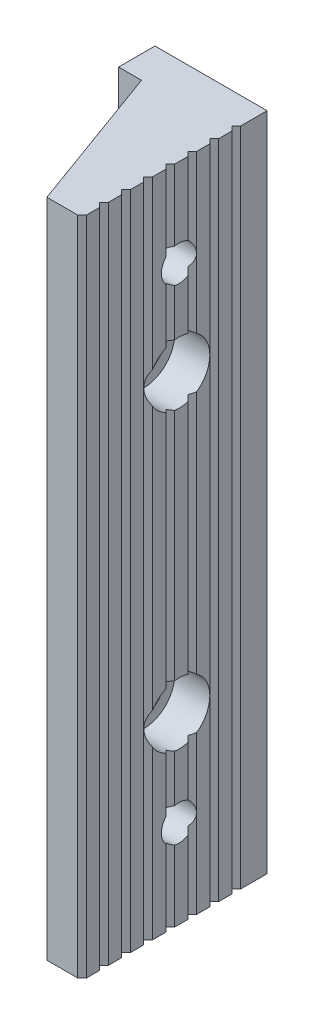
ISO-10303-21;
HEADER;
FILE_DESCRIPTION(('STEP AP214'),'2;1');
FILE_NAME('part.step','',(''),(''),'','','');
FILE_SCHEMA(('AUTOMOTIVE_DESIGN { 1 0 10303 214 1 1 1 1 }'));
ENDSEC;
DATA;
#1=APPLICATION_CONTEXT('core data for automotive mechanical design processes');
#2=APPLICATION_PROTOCOL_DEFINITION('international standard','automotive_design',2000,#1);
#3=PRODUCT_CONTEXT('',#1,'mechanical');
#4=PRODUCT('Part','Part','',(#3));
#5=PRODUCT_RELATED_PRODUCT_CATEGORY('part','',(#4));
#6=PRODUCT_DEFINITION_FORMATION('','',#4);
#7=PRODUCT_DEFINITION_CONTEXT('part definition',#1,'design');
#8=PRODUCT_DEFINITION('design','',#6,#7);
#9=PRODUCT_DEFINITION_SHAPE('','',#8);
#10=(LENGTH_UNIT() NAMED_UNIT(*) SI_UNIT(.MILLI.,.METRE.));
#11=(NAMED_UNIT(*) PLANE_ANGLE_UNIT() SI_UNIT($,.RADIAN.));
#12=(NAMED_UNIT(*) SI_UNIT($,.STERADIAN.) SOLID_ANGLE_UNIT());
#13=UNCERTAINTY_MEASURE_WITH_UNIT(LENGTH_MEASURE(1.E-05),#10,'distance_accuracy_value','');
#14=(GEOMETRIC_REPRESENTATION_CONTEXT(3) GLOBAL_UNCERTAINTY_ASSIGNED_CONTEXT((#13)) GLOBAL_UNIT_ASSIGNED_CONTEXT((#10,
#11,#12)) REPRESENTATION_CONTEXT('',''));
#15=CARTESIAN_POINT('',(0.,0.,0.));
#16=DIRECTION('',(0.,0.,1.));
#17=DIRECTION('',(1.,0.,0.));
#18=AXIS2_PLACEMENT_3D('',#15,#16,#17);
#19=CARTESIAN_POINT('',(-1.0019859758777,-75.,21.9989564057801));
#20=DIRECTION('',(-0.706988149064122,0.,-0.707225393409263));
#21=DIRECTION('',(0.707225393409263,0.,-0.706988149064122));
#22=AXIS2_PLACEMENT_3D('',#19,#20,#21);
#23=PLANE('',#22);
#24=DIRECTION('',(0.,1.,0.));
#25=VECTOR('',#24,1.);
#26=CARTESIAN_POINT('',(4.47558656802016E-13,-75.,20.997306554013));
#27=LINE('',#26,#25);
#28=CARTESIAN_POINT('',(4.47558656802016E-13,-75.,20.997306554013));
#29=VERTEX_POINT('',#28);
#30=CARTESIAN_POINT('',(0.,-58.8736777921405,20.997306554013));
#31=VERTEX_POINT('',#30);
#32=EDGE_CURVE('E399',#29,#31,#27,.T.);
#33=ORIENTED_EDGE('',*,*,#32,.T.);
#34=CARTESIAN_POINT('',(0.99764122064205,-55.,20.));
#35=DIRECTION('',(-0.706988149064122,0.,-0.707225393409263));
#36=DIRECTION('',(0.707225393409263,0.,-0.706988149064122));
#37=AXIS2_PLACEMENT_3D('',#34,#35,#36);
#38=ELLIPSE('',#37,5.6578034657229,4.);
#39=CARTESIAN_POINT('',(-1.0019859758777,-58.4647039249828,21.9989564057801));
#40=VERTEX_POINT('',#39);
#41=EDGE_CURVE('E361',#31,#40,#38,.T.);
#42=ORIENTED_EDGE('',*,*,#41,.T.);
#43=DIRECTION('',(0.,1.,0.));
#44=VECTOR('',#43,1.);
#45=CARTESIAN_POINT('',(-1.0019859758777,-75.,21.9989564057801));
#46=LINE('',#45,#44);
#47=CARTESIAN_POINT('',(-1.0019859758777,-75.,21.9989564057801));
#48=VERTEX_POINT('',#47);
#49=EDGE_CURVE('E417',#48,#40,#46,.T.);
#50=ORIENTED_EDGE('',*,*,#49,.F.);
#51=DIRECTION('',(-0.707225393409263,0.,0.706988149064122));
#52=VECTOR('',#51,1.);
#53=CARTESIAN_POINT('',(-1.0019859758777,-75.,21.9989564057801));
#54=LINE('',#53,#52);
#55=EDGE_CURVE('E558',#29,#48,#54,.T.);
#56=ORIENTED_EDGE('',*,*,#55,.F.);
#57=EDGE_LOOP('',(#33,#42,#50,#56));
#58=FACE_BOUND('',#57,.T.);
#59=ADVANCED_FACE('F14',(#58),#23,.F.);
#60=CARTESIAN_POINT('',(-1.0019859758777,-75.,16.9981018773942));
#61=DIRECTION('',(-0.707225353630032,0.,0.7069881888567));
#62=DIRECTION('',(-0.7069881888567,0.,-0.707225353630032));
#63=AXIS2_PLACEMENT_3D('',#60,#61,#62);
#64=PLANE('',#63);
#65=DIRECTION('',(0.,1.,0.));
#66=VECTOR('',#65,1.);
#67=CARTESIAN_POINT('',(4.47558656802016E-13,-75.,18.0004239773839));
#68=LINE('',#67,#66);
#69=CARTESIAN_POINT('',(0.,-51.5356536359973,18.0004239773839));
#70=VERTEX_POINT('',#69);
#71=CARTESIAN_POINT('',(0.,-40.2083303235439,18.0004239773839));
#72=VERTEX_POINT('',#71);
#73=EDGE_CURVE('E384',#70,#72,#68,.T.);
#74=ORIENTED_EDGE('',*,*,#73,.F.);
#75=CARTESIAN_POINT('',(1.99890547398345,-55.,20.));
#76=DIRECTION('',(-0.707225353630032,0.,0.7069881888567));
#77=DIRECTION('',(0.7069881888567,0.,0.707225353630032));
#78=AXIS2_PLACEMENT_3D('',#75,#76,#77);
#79=ELLIPSE('',#78,5.65590582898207,4.);
#80=CARTESIAN_POINT('',(-1.0019859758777,-52.3564025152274,16.9981018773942));
#81=VERTEX_POINT('',#80);
#82=EDGE_CURVE('E380',#70,#81,#79,.T.);
#83=ORIENTED_EDGE('',*,*,#82,.T.);
#84=DIRECTION('',(0.,1.,0.));
#85=VECTOR('',#84,1.);
#86=CARTESIAN_POINT('',(-1.0019859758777,-75.,16.9981018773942));
#87=LINE('',#86,#85);
#88=CARTESIAN_POINT('',(-1.0019859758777,-39.8236546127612,16.9981018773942));
#89=VERTEX_POINT('',#88);
#90=EDGE_CURVE('E390',#81,#89,#87,.T.);
#91=ORIENTED_EDGE('',*,*,#90,.T.);
#92=CARTESIAN_POINT('',(1.99890547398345,-33.5,20.));
#93=DIRECTION('',(-0.707225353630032,0.,0.7069881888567));
#94=DIRECTION('',(0.7069881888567,0.,0.707225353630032));
#95=AXIS2_PLACEMENT_3D('',#92,#93,#94);
#96=ELLIPSE('',#95,9.8978352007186,7.);
#97=EDGE_CURVE('E674',#89,#72,#96,.T.);
#98=ORIENTED_EDGE('',*,*,#97,.T.);
#99=EDGE_LOOP('',(#74,#83,#91,#98));
#100=FACE_BOUND('',#99,.T.);
#101=ADVANCED_FACE('F798',(#100),#64,.F.);
#102=CARTESIAN_POINT('',(4.47558656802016E-13,-75.,20.997306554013));
#103=DIRECTION('',(-1.,0.,0.));
#104=DIRECTION('',(0.,-1.,0.));
#105=AXIS2_PLACEMENT_3D('',#102,#103,#104);
#106=PLANE('',#105);
#107=CARTESIAN_POINT('',(0.,-51.1263222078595,20.997306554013));
#108=VERTEX_POINT('',#107);
#109=CARTESIAN_POINT('',(0.,-40.42859146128,20.997306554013));
#110=VERTEX_POINT('',#109);
#111=EDGE_CURVE('E405',#108,#110,#27,.T.);
#112=ORIENTED_EDGE('',*,*,#111,.F.);
#113=CARTESIAN_POINT('',(0.,-55.,20.));
#114=DIRECTION('',(1.,0.,0.));
#115=DIRECTION('',(0.,-1.,0.));
#116=AXIS2_PLACEMENT_3D('',#113,#114,#115);
#117=CIRCLE('',#116,4.);
#118=EDGE_CURVE('E367',#70,#108,#117,.T.);
#119=ORIENTED_EDGE('',*,*,#118,.F.);
#120=ORIENTED_EDGE('',*,*,#73,.T.);
#121=CARTESIAN_POINT('',(0.,-33.5,20.));
#122=DIRECTION('',(1.,0.,0.));
#123=DIRECTION('',(0.,1.,0.));
#124=AXIS2_PLACEMENT_3D('',#121,#122,#123);
#125=CIRCLE('',#124,7.);
#126=EDGE_CURVE('E737',#110,#72,#125,.T.);
#127=ORIENTED_EDGE('',*,*,#126,.F.);
#128=EDGE_LOOP('',(#112,#119,#120,#127));
#129=FACE_BOUND('',#128,.T.);
#130=ADVANCED_FACE('F734',(#129),#106,.F.);
#131=CARTESIAN_POINT('',(-1.0019859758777,-75.,21.9989564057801));
#132=DIRECTION('',(-0.706988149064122,0.,0.707225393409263));
#133=DIRECTION('',(-0.707225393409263,0.,-0.706988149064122));
#134=AXIS2_PLACEMENT_3D('',#131,#132,#133);
#135=PLANE('',#134);
#136=DIRECTION('',(0.,1.,0.));
#137=VECTOR('',#136,1.);
#138=CARTESIAN_POINT('',(4.47558656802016E-13,-75.,23.0006062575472));
#139=LINE('',#138,#137);
#140=CARTESIAN_POINT('',(0.,-52.354936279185,23.0006062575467));
#141=VERTEX_POINT('',#140);
#142=CARTESIAN_POINT('',(0.,-39.8242677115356,23.0006062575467));
#143=VERTEX_POINT('',#142);
#144=EDGE_CURVE('E441',#141,#143,#139,.T.);
#145=ORIENTED_EDGE('',*,*,#144,.F.);
#146=CARTESIAN_POINT('',(-3.00161317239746,-55.,20.));
#147=DIRECTION('',(-0.706988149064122,0.,0.707225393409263));
#148=DIRECTION('',(0.707225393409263,0.,0.706988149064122));
#149=AXIS2_PLACEMENT_3D('',#146,#147,#148);
#150=ELLIPSE('',#149,5.6578034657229,4.);
#151=CARTESIAN_POINT('',(-1.0019859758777,-51.5352960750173,21.9989564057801));
#152=VERTEX_POINT('',#151);
#153=EDGE_CURVE('E719',#141,#152,#150,.T.);
#154=ORIENTED_EDGE('',*,*,#153,.T.);
#155=CARTESIAN_POINT('',(-1.0019859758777,-40.2085149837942,21.9989564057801));
#156=VERTEX_POINT('',#155);
#157=EDGE_CURVE('E423',#152,#156,#46,.T.);
#158=ORIENTED_EDGE('',*,*,#157,.T.);
#159=CARTESIAN_POINT('',(-3.00161317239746,-33.5,20.));
#160=DIRECTION('',(-0.706988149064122,0.,0.707225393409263));
#161=DIRECTION('',(0.707225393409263,0.,0.706988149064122));
#162=AXIS2_PLACEMENT_3D('',#159,#160,#161);
#163=ELLIPSE('',#162,9.90115606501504,7.);
#164=EDGE_CURVE('E682',#156,#143,#163,.T.);
#165=ORIENTED_EDGE('',*,*,#164,.T.);
#166=EDGE_LOOP('',(#145,#154,#158,#165));
#167=FACE_BOUND('',#166,.T.);
#168=ADVANCED_FACE('F851',(#167),#135,.F.);
#169=CARTESIAN_POINT('',(0.,58.8736777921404,20.9973065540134));
#170=VERTEX_POINT('',#169);
#171=CARTESIAN_POINT('',(4.47558656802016E-13,75.,20.997306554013));
#172=VERTEX_POINT('',#171);
#173=EDGE_CURVE('E410',#170,#172,#27,.T.);
#174=ORIENTED_EDGE('',*,*,#173,.F.);
#175=CARTESIAN_POINT('',(0.,55.,20.));
#176=DIRECTION('',(1.,0.,0.));
#177=DIRECTION('',(0.,1.,0.));
#178=AXIS2_PLACEMENT_3D('',#175,#176,#177);
#179=CIRCLE('',#178,4.);
#180=CARTESIAN_POINT('',(0.,58.4643463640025,18.0004239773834));
#181=VERTEX_POINT('',#180);
#182=EDGE_CURVE('E713',#181,#170,#179,.T.);
#183=ORIENTED_EDGE('',*,*,#182,.F.);
#184=CARTESIAN_POINT('',(4.47558656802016E-13,75.,18.0004239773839));
#185=VERTEX_POINT('',#184);
#186=EDGE_CURVE('E392',#181,#185,#68,.T.);
#187=ORIENTED_EDGE('',*,*,#186,.T.);
#188=DIRECTION('',(0.,0.,1.));
#189=VECTOR('',#188,1.);
#190=CARTESIAN_POINT('',(4.47558656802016E-13,75.,20.997306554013));
#191=LINE('',#190,#189);
#192=EDGE_CURVE('E616',#185,#172,#191,.T.);
#193=ORIENTED_EDGE('',*,*,#192,.T.);
#194=EDGE_LOOP('',(#174,#183,#187,#193));
#195=FACE_BOUND('',#194,.T.);
#196=ADVANCED_FACE('F853',(#195),#106,.F.);
#197=ORIENTED_EDGE('',*,*,#186,.F.);
#198=CARTESIAN_POINT('',(1.99890547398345,55.,20.));
#199=DIRECTION('',(-0.707225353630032,0.,0.7069881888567));
#200=DIRECTION('',(0.7069881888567,0.,0.707225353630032));
#201=AXIS2_PLACEMENT_3D('',#198,#199,#200);
#202=ELLIPSE('',#201,5.65590582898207,4.);
#203=CARTESIAN_POINT('',(-1.0019859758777,57.6435974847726,16.9981018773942));
#204=VERTEX_POINT('',#203);
#205=EDGE_CURVE('E700',#181,#204,#202,.T.);
#206=ORIENTED_EDGE('',*,*,#205,.T.);
#207=CARTESIAN_POINT('',(-1.0019859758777,75.,16.9981018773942));
#208=VERTEX_POINT('',#207);
#209=EDGE_CURVE('E383',#204,#208,#87,.T.);
#210=ORIENTED_EDGE('',*,*,#209,.T.);
#211=DIRECTION('',(0.7069881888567,0.,0.707225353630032));
#212=VECTOR('',#211,1.);
#213=CARTESIAN_POINT('',(-1.0019859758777,75.,16.9981018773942));
#214=LINE('',#213,#212);
#215=EDGE_CURVE('E618',#208,#185,#214,.T.);
#216=ORIENTED_EDGE('',*,*,#215,.T.);
#217=EDGE_LOOP('',(#197,#206,#210,#216));
#218=FACE_BOUND('',#217,.T.);
#219=ADVANCED_FACE('F863',(#218),#64,.F.);
#220=CARTESIAN_POINT('',(4.47558656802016E-13,57.6450637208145,23.0006062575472));
#221=VERTEX_POINT('',#220);
#222=CARTESIAN_POINT('',(4.47558656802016E-13,75.,23.0006062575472));
#223=VERTEX_POINT('',#222);
#224=EDGE_CURVE('E447',#221,#223,#139,.T.);
#225=ORIENTED_EDGE('',*,*,#224,.F.);
#226=CARTESIAN_POINT('',(-3.00161317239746,55.,20.));
#227=DIRECTION('',(-0.706988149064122,0.,0.707225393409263));
#228=DIRECTION('',(0.707225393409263,0.,0.706988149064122));
#229=AXIS2_PLACEMENT_3D('',#226,#227,#228);
#230=ELLIPSE('',#229,5.6578034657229,4.);
#231=CARTESIAN_POINT('',(-1.0019859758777,58.4647039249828,21.9989564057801));
#232=VERTEX_POINT('',#231);
#233=EDGE_CURVE('E39',#221,#232,#230,.T.);
#234=ORIENTED_EDGE('',*,*,#233,.T.);
#235=CARTESIAN_POINT('',(-1.0019859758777,75.,21.9989564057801));
#236=VERTEX_POINT('',#235);
#237=EDGE_CURVE('E429',#232,#236,#46,.T.);
#238=ORIENTED_EDGE('',*,*,#237,.T.);
#239=DIRECTION('',(0.707225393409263,0.,0.706988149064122));
#240=VECTOR('',#239,1.);
#241=CARTESIAN_POINT('',(-1.0019859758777,75.,21.9989564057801));
#242=LINE('',#241,#240);
#243=EDGE_CURVE('E612',#236,#223,#242,.T.);
#244=ORIENTED_EDGE('',*,*,#243,.T.);
#245=EDGE_LOOP('',(#225,#234,#238,#244));
#246=FACE_BOUND('',#245,.T.);
#247=ADVANCED_FACE('F855',(#246),#135,.F.);
#248=CARTESIAN_POINT('',(0.,40.42859146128,20.9973065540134));
#249=VERTEX_POINT('',#248);
#250=CARTESIAN_POINT('',(0.,51.1263222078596,20.9973065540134));
#251=VERTEX_POINT('',#250);
#252=EDGE_CURVE('E406',#249,#251,#27,.T.);
#253=ORIENTED_EDGE('',*,*,#252,.T.);
#254=CARTESIAN_POINT('',(0.99764122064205,55.,20.));
#255=DIRECTION('',(-0.706988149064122,0.,-0.707225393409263));
#256=DIRECTION('',(0.707225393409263,0.,-0.706988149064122));
#257=AXIS2_PLACEMENT_3D('',#254,#255,#256);
#258=ELLIPSE('',#257,5.6578034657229,4.);
#259=CARTESIAN_POINT('',(-1.0019859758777,51.5352960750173,21.9989564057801));
#260=VERTEX_POINT('',#259);
#261=EDGE_CURVE('E709',#251,#260,#258,.T.);
#262=ORIENTED_EDGE('',*,*,#261,.T.);
#263=CARTESIAN_POINT('',(-1.0019859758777,40.2085149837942,21.9989564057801));
#264=VERTEX_POINT('',#263);
#265=EDGE_CURVE('E424',#264,#260,#46,.T.);
#266=ORIENTED_EDGE('',*,*,#265,.F.);
#267=CARTESIAN_POINT('',(0.99764122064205,33.5,20.));
#268=DIRECTION('',(-0.706988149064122,0.,-0.707225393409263));
#269=DIRECTION('',(0.707225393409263,0.,-0.706988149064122));
#270=AXIS2_PLACEMENT_3D('',#267,#268,#269);
#271=ELLIPSE('',#270,9.90115606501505,7.);
#272=EDGE_CURVE('E647',#264,#249,#271,.T.);
#273=ORIENTED_EDGE('',*,*,#272,.T.);
#274=EDGE_LOOP('',(#253,#262,#266,#273));
#275=FACE_BOUND('',#274,.T.);
#276=ADVANCED_FACE('F869',(#275),#23,.F.);
#277=CARTESIAN_POINT('',(-1.0019859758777,-75.,16.9981018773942));
#278=DIRECTION('',(-0.706988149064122,0.,-0.707225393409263));
#279=DIRECTION('',(0.707225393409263,0.,-0.706988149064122));
#280=AXIS2_PLACEMENT_3D('',#277,#278,#279);
#281=PLANE('',#280);
#282=ORIENTED_EDGE('',*,*,#90,.F.);
#283=CARTESIAN_POINT('',(-4.004891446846,-55.,20.));
#284=DIRECTION('',(-0.706988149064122,0.,-0.707225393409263));
#285=DIRECTION('',(0.707225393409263,0.,-0.706988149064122));
#286=AXIS2_PLACEMENT_3D('',#283,#284,#285);
#287=ELLIPSE('',#286,5.6578034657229,4.);
#288=CARTESIAN_POINT('',(-1.0019859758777,-57.6435974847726,16.9981018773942));
#289=VERTEX_POINT('',#288);
#290=EDGE_CURVE('E377',#81,#289,#287,.T.);
#291=ORIENTED_EDGE('',*,*,#290,.T.);
#292=CARTESIAN_POINT('',(-1.0019859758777,-75.,16.9981018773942));
#293=VERTEX_POINT('',#292);
#294=EDGE_CURVE('E376',#293,#289,#87,.T.);
#295=ORIENTED_EDGE('',*,*,#294,.F.);
#296=DIRECTION('',(-0.707225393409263,0.,0.706988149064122));
#297=VECTOR('',#296,1.);
#298=CARTESIAN_POINT('',(-1.0019859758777,-75.,16.9981018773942));
#299=LINE('',#298,#297);
#300=CARTESIAN_POINT('',(4.47558656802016E-13,-75.,15.9964520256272));
#301=VERTEX_POINT('',#300);
#302=EDGE_CURVE('E563',#301,#293,#299,.T.);
#303=ORIENTED_EDGE('',*,*,#302,.F.);
#304=DIRECTION('',(0.,1.,0.));
#305=VECTOR('',#304,1.);
#306=CARTESIAN_POINT('',(4.47558656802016E-13,-75.,15.9964520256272));
#307=LINE('',#306,#305);
#308=CARTESIAN_POINT('',(0.,-39.2420905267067,15.9964520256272));
#309=VERTEX_POINT('',#308);
#310=EDGE_CURVE('E758',#301,#309,#307,.T.);
#311=ORIENTED_EDGE('',*,*,#310,.T.);
#312=CARTESIAN_POINT('',(-4.004891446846,-33.5,20.));
#313=DIRECTION('',(-0.706988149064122,0.,-0.707225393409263));
#314=DIRECTION('',(0.707225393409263,0.,-0.706988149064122));
#315=AXIS2_PLACEMENT_3D('',#312,#313,#314);
#316=ELLIPSE('',#315,9.90115606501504,7.);
#317=EDGE_CURVE('E670',#309,#89,#316,.T.);
#318=ORIENTED_EDGE('',*,*,#317,.T.);
#319=EDGE_LOOP('',(#282,#291,#295,#303,#311,#318));
#320=FACE_BOUND('',#319,.T.);
#321=ADVANCED_FACE('F800',(#320),#281,.F.);
#322=ORIENTED_EDGE('',*,*,#157,.F.);
#323=EDGE_CURVE('E378',#152,#108,#38,.T.);
#324=ORIENTED_EDGE('',*,*,#323,.T.);
#325=ORIENTED_EDGE('',*,*,#111,.T.);
#326=CARTESIAN_POINT('',(0.99764122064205,-33.5,20.));
#327=DIRECTION('',(-0.706988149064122,0.,-0.707225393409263));
#328=DIRECTION('',(0.707225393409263,0.,-0.706988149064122));
#329=AXIS2_PLACEMENT_3D('',#326,#327,#328);
#330=ELLIPSE('',#329,9.90115606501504,7.);
#331=EDGE_CURVE('E678',#110,#156,#330,.T.);
#332=ORIENTED_EDGE('',*,*,#331,.T.);
#333=EDGE_LOOP('',(#322,#324,#325,#332));
#334=FACE_BOUND('',#333,.T.);
#335=ADVANCED_FACE('F729',(#334),#23,.F.);
#336=CARTESIAN_POINT('',(4.47558656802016E-13,-75.,25.9974888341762));
#337=DIRECTION('',(-1.,0.,0.));
#338=DIRECTION('',(0.,-1.,0.));
#339=AXIS2_PLACEMENT_3D('',#336,#337,#338);
#340=PLANE('',#339);
#341=CARTESIAN_POINT('',(4.47558656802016E-13,-75.,23.0006062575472));
#342=VERTEX_POINT('',#341);
#343=CARTESIAN_POINT('',(4.47558656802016E-13,-57.645063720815,23.0006062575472));
#344=VERTEX_POINT('',#343);
#345=EDGE_CURVE('E436',#342,#344,#139,.T.);
#346=ORIENTED_EDGE('',*,*,#345,.T.);
#347=EDGE_CURVE('E31',#141,#344,#117,.T.);
#348=ORIENTED_EDGE('',*,*,#347,.F.);
#349=ORIENTED_EDGE('',*,*,#144,.T.);
#350=CARTESIAN_POINT('',(0.,-37.109726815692,25.9974888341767));
#351=VERTEX_POINT('',#350);
#352=EDGE_CURVE('E740',#351,#143,#125,.T.);
#353=ORIENTED_EDGE('',*,*,#352,.F.);
#354=DIRECTION('',(0.,1.,0.));
#355=VECTOR('',#354,1.);
#356=CARTESIAN_POINT('',(4.47558656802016E-13,-75.,25.9974888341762));
#357=LINE('',#356,#355);
#358=CARTESIAN_POINT('',(4.47558656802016E-13,-75.,25.9974888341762));
#359=VERTEX_POINT('',#358);
#360=EDGE_CURVE('E453',#359,#351,#357,.T.);
#361=ORIENTED_EDGE('',*,*,#360,.F.);
#362=DIRECTION('',(0.,0.,1.));
#363=VECTOR('',#362,1.);
#364=CARTESIAN_POINT('',(4.47558656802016E-13,-75.,25.9974888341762));
#365=LINE('',#364,#363);
#366=EDGE_CURVE('E554',#342,#359,#365,.T.);
#367=ORIENTED_EDGE('',*,*,#366,.F.);
#368=EDGE_LOOP('',(#346,#348,#349,#353,#361,#367));
#369=FACE_BOUND('',#368,.T.);
#370=ADVANCED_FACE('F850',(#369),#340,.F.);
#371=CARTESIAN_POINT('',(-1.0019859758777,-75.,26.9998109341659));
#372=DIRECTION('',(-0.707225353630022,0.,-0.706988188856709));
#373=DIRECTION('',(0.706988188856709,0.,-0.707225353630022));
#374=AXIS2_PLACEMENT_3D('',#371,#372,#373);
#375=PLANE('',#374);
#376=ORIENTED_EDGE('',*,*,#360,.T.);
#377=CARTESIAN_POINT('',(5.9954776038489,-33.5,20.));
#378=DIRECTION('',(-0.707225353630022,0.,-0.706988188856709));
#379=DIRECTION('',(0.706988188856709,0.,-0.707225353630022));
#380=AXIS2_PLACEMENT_3D('',#377,#378,#379);
#381=ELLIPSE('',#380,9.89783520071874,7.);
#382=CARTESIAN_POINT('',(-1.0019859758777,-33.5514478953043,26.9998109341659));
#383=VERTEX_POINT('',#382);
#384=EDGE_CURVE('E685',#351,#383,#381,.T.);
#385=ORIENTED_EDGE('',*,*,#384,.T.);
#386=DIRECTION('',(0.,1.,0.));
#387=VECTOR('',#386,1.);
#388=CARTESIAN_POINT('',(-1.0019859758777,-75.,26.9998109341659));
#389=LINE('',#388,#387);
#390=CARTESIAN_POINT('',(-1.0019859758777,-75.,26.9998109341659));
#391=VERTEX_POINT('',#390);
#392=EDGE_CURVE('E464',#391,#383,#389,.T.);
#393=ORIENTED_EDGE('',*,*,#392,.F.);
#394=DIRECTION('',(-0.706988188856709,0.,0.707225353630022));
#395=VECTOR('',#394,1.);
#396=CARTESIAN_POINT('',(-1.0019859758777,-75.,26.9998109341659));
#397=LINE('',#396,#395);
#398=EDGE_CURVE('E552',#359,#391,#397,.T.);
#399=ORIENTED_EDGE('',*,*,#398,.F.);
#400=EDGE_LOOP('',(#376,#385,#393,#399));
#401=FACE_BOUND('',#400,.T.);
#402=ADVANCED_FACE('F847',(#401),#375,.F.);
#403=CARTESIAN_POINT('',(0.,-26.7916696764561,18.0004239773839));
#404=VERTEX_POINT('',#403);
#405=CARTESIAN_POINT('',(0.,26.7916696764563,18.0004239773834));
#406=VERTEX_POINT('',#405);
#407=EDGE_CURVE('E391',#404,#406,#68,.T.);
#408=ORIENTED_EDGE('',*,*,#407,.F.);
#409=CARTESIAN_POINT('',(-1.0019859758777,-27.1763453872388,16.9981018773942));
#410=VERTEX_POINT('',#409);
#411=EDGE_CURVE('E673',#404,#410,#96,.T.);
#412=ORIENTED_EDGE('',*,*,#411,.T.);
#413=CARTESIAN_POINT('',(-1.0019859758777,27.1763453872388,16.9981018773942));
#414=VERTEX_POINT('',#413);
#415=EDGE_CURVE('E389',#410,#414,#87,.T.);
#416=ORIENTED_EDGE('',*,*,#415,.T.);
#417=CARTESIAN_POINT('',(1.99890547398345,33.5,20.));
#418=DIRECTION('',(-0.707225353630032,0.,0.7069881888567));
#419=DIRECTION('',(0.7069881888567,0.,0.707225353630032));
#420=AXIS2_PLACEMENT_3D('',#417,#418,#419);
#421=ELLIPSE('',#420,9.89783520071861,7.);
#422=EDGE_CURVE('E644',#414,#406,#421,.T.);
#423=ORIENTED_EDGE('',*,*,#422,.T.);
#424=EDGE_LOOP('',(#408,#412,#416,#423));
#425=FACE_BOUND('',#424,.T.);
#426=ADVANCED_FACE('F896',(#425),#64,.F.);
#427=CARTESIAN_POINT('',(0.,-26.57140853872,20.997306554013));
#428=VERTEX_POINT('',#427);
#429=CARTESIAN_POINT('',(0.,26.5714085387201,20.9973065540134));
#430=VERTEX_POINT('',#429);
#431=EDGE_CURVE('E409',#428,#430,#27,.T.);
#432=ORIENTED_EDGE('',*,*,#431,.F.);
#433=EDGE_CURVE('E690',#404,#428,#125,.T.);
#434=ORIENTED_EDGE('',*,*,#433,.F.);
#435=ORIENTED_EDGE('',*,*,#407,.T.);
#436=CARTESIAN_POINT('',(0.,33.5,20.));
#437=DIRECTION('',(1.,0.,0.));
#438=DIRECTION('',(0.,1.,0.));
#439=AXIS2_PLACEMENT_3D('',#436,#437,#438);
#440=CIRCLE('',#439,7.);
#441=EDGE_CURVE('E825',#430,#406,#440,.T.);
#442=ORIENTED_EDGE('',*,*,#441,.F.);
#443=EDGE_LOOP('',(#432,#434,#435,#442));
#444=FACE_BOUND('',#443,.T.);
#445=ADVANCED_FACE('F865',(#444),#106,.F.);
#446=CARTESIAN_POINT('',(0.,-27.1757322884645,23.0006062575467));
#447=VERTEX_POINT('',#446);
#448=CARTESIAN_POINT('',(0.,27.1757322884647,23.0006062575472));
#449=VERTEX_POINT('',#448);
#450=EDGE_CURVE('E446',#447,#449,#139,.T.);
#451=ORIENTED_EDGE('',*,*,#450,.F.);
#452=CARTESIAN_POINT('',(-1.0019859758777,-26.7914850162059,21.9989564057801));
#453=VERTEX_POINT('',#452);
#454=EDGE_CURVE('E681',#447,#453,#163,.T.);
#455=ORIENTED_EDGE('',*,*,#454,.T.);
#456=CARTESIAN_POINT('',(-1.0019859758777,26.7914850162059,21.9989564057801));
#457=VERTEX_POINT('',#456);
#458=EDGE_CURVE('E428',#453,#457,#46,.T.);
#459=ORIENTED_EDGE('',*,*,#458,.T.);
#460=CARTESIAN_POINT('',(-3.00161317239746,33.5,20.));
#461=DIRECTION('',(-0.706988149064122,0.,0.707225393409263));
#462=DIRECTION('',(0.707225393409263,0.,0.706988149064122));
#463=AXIS2_PLACEMENT_3D('',#460,#461,#462);
#464=ELLIPSE('',#463,9.90115606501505,7.);
#465=EDGE_CURVE('E652',#457,#449,#464,.T.);
#466=ORIENTED_EDGE('',*,*,#465,.T.);
#467=EDGE_LOOP('',(#451,#455,#459,#466));
#468=FACE_BOUND('',#467,.T.);
#469=ADVANCED_FACE('F870',(#468),#135,.F.);
#470=CARTESIAN_POINT('',(0.,40.2083303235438,18.0004239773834));
#471=VERTEX_POINT('',#470);
#472=CARTESIAN_POINT('',(0.,51.5356536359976,18.0004239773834));
#473=VERTEX_POINT('',#472);
#474=EDGE_CURVE('E386',#471,#473,#68,.T.);
#475=ORIENTED_EDGE('',*,*,#474,.T.);
#476=EDGE_CURVE('E715',#251,#473,#179,.T.);
#477=ORIENTED_EDGE('',*,*,#476,.F.);
#478=ORIENTED_EDGE('',*,*,#252,.F.);
#479=EDGE_CURVE('E659',#471,#249,#440,.T.);
#480=ORIENTED_EDGE('',*,*,#479,.F.);
#481=EDGE_LOOP('',(#475,#477,#478,#480));
#482=FACE_BOUND('',#481,.T.);
#483=ADVANCED_FACE('F887',(#482),#106,.F.);
#484=ORIENTED_EDGE('',*,*,#415,.F.);
#485=CARTESIAN_POINT('',(0.,-27.7579094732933,15.9964520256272));
#486=VERTEX_POINT('',#485);
#487=EDGE_CURVE('E669',#410,#486,#316,.T.);
#488=ORIENTED_EDGE('',*,*,#487,.T.);
#489=CARTESIAN_POINT('',(0.,27.757909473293,15.9964520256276));
#490=VERTEX_POINT('',#489);
#491=EDGE_CURVE('E753',#486,#490,#307,.T.);
#492=ORIENTED_EDGE('',*,*,#491,.T.);
#493=CARTESIAN_POINT('',(-4.004891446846,33.5,20.));
#494=DIRECTION('',(-0.706988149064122,0.,-0.707225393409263));
#495=DIRECTION('',(0.707225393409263,0.,-0.706988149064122));
#496=AXIS2_PLACEMENT_3D('',#493,#494,#495);
#497=ELLIPSE('',#496,9.90115606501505,7.);
#498=EDGE_CURVE('E640',#490,#414,#497,.T.);
#499=ORIENTED_EDGE('',*,*,#498,.T.);
#500=EDGE_LOOP('',(#484,#488,#492,#499));
#501=FACE_BOUND('',#500,.T.);
#502=ADVANCED_FACE('F752',(#501),#281,.F.);
#503=CARTESIAN_POINT('',(-1.0019859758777,39.8236546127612,16.9981018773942));
#504=VERTEX_POINT('',#503);
#505=CARTESIAN_POINT('',(-1.0019859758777,52.3564025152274,16.9981018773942));
#506=VERTEX_POINT('',#505);
#507=EDGE_CURVE('E387',#504,#506,#87,.T.);
#508=ORIENTED_EDGE('',*,*,#507,.T.);
#509=EDGE_CURVE('E701',#506,#473,#202,.T.);
#510=ORIENTED_EDGE('',*,*,#509,.T.);
#511=ORIENTED_EDGE('',*,*,#474,.F.);
#512=EDGE_CURVE('E643',#471,#504,#421,.T.);
#513=ORIENTED_EDGE('',*,*,#512,.T.);
#514=EDGE_LOOP('',(#508,#510,#511,#513));
#515=FACE_BOUND('',#514,.T.);
#516=ADVANCED_FACE('F790',(#515),#64,.F.);
#517=ORIENTED_EDGE('',*,*,#458,.F.);
#518=EDGE_CURVE('E677',#453,#428,#330,.T.);
#519=ORIENTED_EDGE('',*,*,#518,.T.);
#520=ORIENTED_EDGE('',*,*,#431,.T.);
#521=EDGE_CURVE('E648',#430,#457,#271,.T.);
#522=ORIENTED_EDGE('',*,*,#521,.T.);
#523=EDGE_LOOP('',(#517,#519,#520,#522));
#524=FACE_BOUND('',#523,.T.);
#525=ADVANCED_FACE('F882',(#524),#23,.F.);
#526=ORIENTED_EDGE('',*,*,#265,.T.);
#527=CARTESIAN_POINT('',(0.,52.3549362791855,23.0006062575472));
#528=VERTEX_POINT('',#527);
#529=EDGE_CURVE('E707',#260,#528,#230,.T.);
#530=ORIENTED_EDGE('',*,*,#529,.T.);
#531=CARTESIAN_POINT('',(0.,39.8242677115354,23.0006062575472));
#532=VERTEX_POINT('',#531);
#533=EDGE_CURVE('E442',#532,#528,#139,.T.);
#534=ORIENTED_EDGE('',*,*,#533,.F.);
#535=EDGE_CURVE('E651',#532,#264,#464,.T.);
#536=ORIENTED_EDGE('',*,*,#535,.T.);
#537=EDGE_LOOP('',(#526,#530,#534,#536));
#538=FACE_BOUND('',#537,.T.);
#539=ADVANCED_FACE('F873',(#538),#135,.F.);
#540=CARTESIAN_POINT('',(0.,-29.890273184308,25.9974888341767));
#541=VERTEX_POINT('',#540);
#542=CARTESIAN_POINT('',(0.,29.890273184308,25.9974888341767));
#543=VERTEX_POINT('',#542);
#544=EDGE_CURVE('E457',#541,#543,#357,.T.);
#545=ORIENTED_EDGE('',*,*,#544,.F.);
#546=EDGE_CURVE('E694',#447,#541,#125,.T.);
#547=ORIENTED_EDGE('',*,*,#546,.F.);
#548=ORIENTED_EDGE('',*,*,#450,.T.);
#549=EDGE_CURVE('E827',#543,#449,#440,.T.);
#550=ORIENTED_EDGE('',*,*,#549,.F.);
#551=EDGE_LOOP('',(#545,#547,#548,#550));
#552=FACE_BOUND('',#551,.T.);
#553=ADVANCED_FACE('F895',(#552),#340,.F.);
#554=CARTESIAN_POINT('',(-1.0019859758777,-33.4485521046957,26.9998109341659));
#555=VERTEX_POINT('',#554);
#556=CARTESIAN_POINT('',(-1.0019859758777,33.4485521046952,26.9998109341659));
#557=VERTEX_POINT('',#556);
#558=EDGE_CURVE('E470',#555,#557,#389,.T.);
#559=ORIENTED_EDGE('',*,*,#558,.F.);
#560=EDGE_CURVE('E686',#555,#541,#381,.T.);
#561=ORIENTED_EDGE('',*,*,#560,.T.);
#562=ORIENTED_EDGE('',*,*,#544,.T.);
#563=CARTESIAN_POINT('',(5.9954776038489,33.5,20.));
#564=DIRECTION('',(-0.707225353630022,0.,-0.706988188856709));
#565=DIRECTION('',(0.706988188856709,0.,-0.707225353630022));
#566=AXIS2_PLACEMENT_3D('',#563,#564,#565);
#567=ELLIPSE('',#566,9.89783520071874,7.);
#568=EDGE_CURVE('E655',#543,#557,#567,.T.);
#569=ORIENTED_EDGE('',*,*,#568,.T.);
#570=EDGE_LOOP('',(#559,#561,#562,#569));
#571=FACE_BOUND('',#570,.T.);
#572=ADVANCED_FACE('F940',(#571),#375,.F.);
#573=CARTESIAN_POINT('',(4.47558656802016E-13,-75.,5.99474296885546));
#574=DIRECTION('',(-1.,0.,0.));
#575=DIRECTION('',(0.,0.,-1.));
#576=AXIS2_PLACEMENT_3D('',#573,#574,#575);
#577=PLANE('',#576);
#578=DIRECTION('',(0.,0.,1.));
#579=VECTOR('',#578,1.);
#580=CARTESIAN_POINT('',(4.47558656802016E-13,75.,5.99474296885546));
#581=LINE('',#580,#579);
#582=CARTESIAN_POINT('',(0.,75.,0.));
#583=VERTEX_POINT('',#582);
#584=CARTESIAN_POINT('',(4.47558656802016E-13,75.,5.99474296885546));
#585=VERTEX_POINT('',#584);
#586=EDGE_CURVE('E636',#583,#585,#581,.T.);
#587=ORIENTED_EDGE('',*,*,#586,.T.);
#588=DIRECTION('',(0.,1.,0.));
#589=VECTOR('',#588,1.);
#590=CARTESIAN_POINT('',(4.47558656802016E-13,-75.,5.99474296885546));
#591=LINE('',#590,#589);
#592=CARTESIAN_POINT('',(4.47558656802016E-13,-75.,5.99474296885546));
#593=VERTEX_POINT('',#592);
#594=EDGE_CURVE('E777',#593,#585,#591,.T.);
#595=ORIENTED_EDGE('',*,*,#594,.F.);
#596=DIRECTION('',(0.,0.,1.));
#597=VECTOR('',#596,1.);
#598=CARTESIAN_POINT('',(4.47558656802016E-13,-75.,5.99474296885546));
#599=LINE('',#598,#597);
#600=CARTESIAN_POINT('',(0.,-75.,0.));
#601=VERTEX_POINT('',#600);
#602=EDGE_CURVE('E577',#601,#593,#599,.T.);
#603=ORIENTED_EDGE('',*,*,#602,.F.);
#604=DIRECTION('',(0.,1.,0.));
#605=VECTOR('',#604,1.);
#606=CARTESIAN_POINT('',(0.,-75.,0.));
#607=LINE('',#606,#605);
#608=EDGE_CURVE('E521',#601,#583,#607,.T.);
#609=ORIENTED_EDGE('',*,*,#608,.T.);
#610=EDGE_LOOP('',(#587,#595,#603,#609));
#611=FACE_BOUND('',#610,.T.);
#612=ADVANCED_FACE('F16',(#611),#577,.F.);
#613=CARTESIAN_POINT('',(-1.0019859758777,-75.,6.99639282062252));
#614=DIRECTION('',(-0.706988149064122,0.,-0.707225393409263));
#615=DIRECTION('',(0.707225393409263,0.,-0.706988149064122));
#616=AXIS2_PLACEMENT_3D('',#613,#614,#615);
#617=PLANE('',#616);
#618=DIRECTION('',(-0.707225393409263,0.,0.706988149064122));
#619=VECTOR('',#618,1.);
#620=CARTESIAN_POINT('',(-1.0019859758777,75.,6.99639282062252));
#621=LINE('',#620,#619);
#622=CARTESIAN_POINT('',(-1.0019859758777,75.,6.99639282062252));
#623=VERTEX_POINT('',#622);
#624=EDGE_CURVE('E634',#585,#623,#621,.T.);
#625=ORIENTED_EDGE('',*,*,#624,.T.);
#626=DIRECTION('',(0.,1.,0.));
#627=VECTOR('',#626,1.);
#628=CARTESIAN_POINT('',(-1.0019859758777,-75.,6.99639282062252));
#629=LINE('',#628,#627);
#630=CARTESIAN_POINT('',(-1.0019859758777,-75.,6.99639282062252));
#631=VERTEX_POINT('',#630);
#632=EDGE_CURVE('E774',#631,#623,#629,.T.);
#633=ORIENTED_EDGE('',*,*,#632,.F.);
#634=DIRECTION('',(-0.707225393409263,0.,0.706988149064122));
#635=VECTOR('',#634,1.);
#636=CARTESIAN_POINT('',(-1.0019859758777,-75.,6.99639282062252));
#637=LINE('',#636,#635);
#638=EDGE_CURVE('E575',#593,#631,#637,.T.);
#639=ORIENTED_EDGE('',*,*,#638,.F.);
#640=ORIENTED_EDGE('',*,*,#594,.T.);
#641=EDGE_LOOP('',(#625,#633,#639,#640));
#642=FACE_BOUND('',#641,.T.);
#643=ADVANCED_FACE('F932',(#642),#617,.F.);
#644=CARTESIAN_POINT('',(-1.0019859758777,-75.,6.99639282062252));
#645=DIRECTION('',(-0.706988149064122,0.,0.707225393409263));
#646=DIRECTION('',(-0.707225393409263,0.,-0.706988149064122));
#647=AXIS2_PLACEMENT_3D('',#644,#645,#646);
#648=PLANE('',#647);
#649=DIRECTION('',(0.707225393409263,0.,0.706988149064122));
#650=VECTOR('',#649,1.);
#651=CARTESIAN_POINT('',(-1.0019859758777,75.,6.99639282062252));
#652=LINE('',#651,#650);
#653=CARTESIAN_POINT('',(4.47558656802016E-13,75.,7.9980426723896));
#654=VERTEX_POINT('',#653);
#655=EDGE_CURVE('E632',#623,#654,#652,.T.);
#656=ORIENTED_EDGE('',*,*,#655,.T.);
#657=DIRECTION('',(0.,1.,0.));
#658=VECTOR('',#657,1.);
#659=CARTESIAN_POINT('',(4.47558656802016E-13,-75.,7.9980426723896));
#660=LINE('',#659,#658);
#661=CARTESIAN_POINT('',(4.47558656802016E-13,-75.,7.9980426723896));
#662=VERTEX_POINT('',#661);
#663=EDGE_CURVE('E771',#662,#654,#660,.T.);
#664=ORIENTED_EDGE('',*,*,#663,.F.);
#665=DIRECTION('',(0.707225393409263,0.,0.706988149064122));
#666=VECTOR('',#665,1.);
#667=CARTESIAN_POINT('',(-1.0019859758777,-75.,6.99639282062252));
#668=LINE('',#667,#666);
#669=EDGE_CURVE('E573',#631,#662,#668,.T.);
#670=ORIENTED_EDGE('',*,*,#669,.F.);
#671=ORIENTED_EDGE('',*,*,#632,.T.);
#672=EDGE_LOOP('',(#656,#664,#670,#671));
#673=FACE_BOUND('',#672,.T.);
#674=ADVANCED_FACE('F929',(#673),#648,.F.);
#675=CARTESIAN_POINT('',(4.47558656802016E-13,-75.,10.9955974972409));
#676=DIRECTION('',(-1.,0.,0.));
#677=DIRECTION('',(0.,-1.,0.));
#678=AXIS2_PLACEMENT_3D('',#675,#676,#677);
#679=PLANE('',#678);
#680=DIRECTION('',(0.,0.,1.));
#681=VECTOR('',#680,1.);
#682=CARTESIAN_POINT('',(4.47558656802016E-13,75.,10.9955974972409));
#683=LINE('',#682,#681);
#684=CARTESIAN_POINT('',(4.47558656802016E-13,75.,10.9955974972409));
#685=VERTEX_POINT('',#684);
#686=EDGE_CURVE('E630',#654,#685,#683,.T.);
#687=ORIENTED_EDGE('',*,*,#686,.T.);
#688=DIRECTION('',(0.,1.,0.));
#689=VECTOR('',#688,1.);
#690=CARTESIAN_POINT('',(4.47558656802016E-13,-75.,10.9955974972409));
#691=LINE('',#690,#689);
#692=CARTESIAN_POINT('',(4.47558656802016E-13,-75.,10.9955974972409));
#693=VERTEX_POINT('',#692);
#694=EDGE_CURVE('E768',#693,#685,#691,.T.);
#695=ORIENTED_EDGE('',*,*,#694,.F.);
#696=DIRECTION('',(0.,0.,1.));
#697=VECTOR('',#696,1.);
#698=CARTESIAN_POINT('',(4.47558656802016E-13,-75.,10.9955974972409));
#699=LINE('',#698,#697);
#700=EDGE_CURVE('E571',#662,#693,#699,.T.);
#701=ORIENTED_EDGE('',*,*,#700,.F.);
#702=ORIENTED_EDGE('',*,*,#663,.T.);
#703=EDGE_LOOP('',(#687,#695,#701,#702));
#704=FACE_BOUND('',#703,.T.);
#705=ADVANCED_FACE('F925',(#704),#679,.F.);
#706=CARTESIAN_POINT('',(-1.0019859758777,-75.,11.997919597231));
#707=DIRECTION('',(-0.707225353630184,0.,-0.706988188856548));
#708=DIRECTION('',(0.706988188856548,0.,-0.707225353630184));
#709=AXIS2_PLACEMENT_3D('',#706,#707,#708);
#710=PLANE('',#709);
#711=DIRECTION('',(-0.706988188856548,0.,0.707225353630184));
#712=VECTOR('',#711,1.);
#713=CARTESIAN_POINT('',(-1.0019859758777,75.,11.997919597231));
#714=LINE('',#713,#712);
#715=CARTESIAN_POINT('',(-1.0019859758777,75.,11.997919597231));
#716=VERTEX_POINT('',#715);
#717=EDGE_CURVE('E628',#685,#716,#714,.T.);
#718=ORIENTED_EDGE('',*,*,#717,.T.);
#719=DIRECTION('',(0.,1.,0.));
#720=VECTOR('',#719,1.);
#721=CARTESIAN_POINT('',(-1.0019859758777,-75.,11.997919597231));
#722=LINE('',#721,#720);
#723=CARTESIAN_POINT('',(-1.0019859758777,-75.,11.997919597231));
#724=VERTEX_POINT('',#723);
#725=EDGE_CURVE('E765',#724,#716,#722,.T.);
#726=ORIENTED_EDGE('',*,*,#725,.F.);
#727=DIRECTION('',(-0.706988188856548,0.,0.707225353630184));
#728=VECTOR('',#727,1.);
#729=CARTESIAN_POINT('',(-1.0019859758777,-75.,11.997919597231));
#730=LINE('',#729,#728);
#731=EDGE_CURVE('E569',#693,#724,#730,.T.);
#732=ORIENTED_EDGE('',*,*,#731,.F.);
#733=ORIENTED_EDGE('',*,*,#694,.T.);
#734=EDGE_LOOP('',(#718,#726,#732,#733));
#735=FACE_BOUND('',#734,.T.);
#736=ADVANCED_FACE('F920',(#735),#710,.F.);
#737=CARTESIAN_POINT('',(-1.0019859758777,-75.,11.997919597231));
#738=DIRECTION('',(-0.706988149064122,0.,0.707225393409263));
#739=DIRECTION('',(-0.707225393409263,0.,-0.706988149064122));
#740=AXIS2_PLACEMENT_3D('',#737,#738,#739);
#741=PLANE('',#740);
#742=DIRECTION('',(0.707225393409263,0.,0.706988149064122));
#743=VECTOR('',#742,1.);
#744=CARTESIAN_POINT('',(-1.0019859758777,75.,11.997919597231));
#745=LINE('',#744,#743);
#746=CARTESIAN_POINT('',(4.47558656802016E-13,75.,12.999569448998));
#747=VERTEX_POINT('',#746);
#748=EDGE_CURVE('E626',#716,#747,#745,.T.);
#749=ORIENTED_EDGE('',*,*,#748,.T.);
#750=DIRECTION('',(0.,1.,0.));
#751=VECTOR('',#750,1.);
#752=CARTESIAN_POINT('',(4.47558656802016E-13,-75.,12.999569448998));
#753=LINE('',#752,#751);
#754=CARTESIAN_POINT('',(4.47558656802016E-13,-75.,12.999569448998));
#755=VERTEX_POINT('',#754);
#756=EDGE_CURVE('E761',#755,#747,#753,.T.);
#757=ORIENTED_EDGE('',*,*,#756,.F.);
#758=DIRECTION('',(0.707225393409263,0.,0.706988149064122));
#759=VECTOR('',#758,1.);
#760=CARTESIAN_POINT('',(-1.0019859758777,-75.,11.997919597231));
#761=LINE('',#760,#759);
#762=EDGE_CURVE('E567',#724,#755,#761,.T.);
#763=ORIENTED_EDGE('',*,*,#762,.F.);
#764=ORIENTED_EDGE('',*,*,#725,.T.);
#765=EDGE_LOOP('',(#749,#757,#763,#764));
#766=FACE_BOUND('',#765,.T.);
#767=ADVANCED_FACE('F811',(#766),#741,.F.);
#768=CARTESIAN_POINT('',(4.47558656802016E-13,-75.,15.9964520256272));
#769=DIRECTION('',(-1.,0.,0.));
#770=DIRECTION('',(0.,-1.,0.));
#771=AXIS2_PLACEMENT_3D('',#768,#769,#770);
#772=PLANE('',#771);
#773=ORIENTED_EDGE('',*,*,#491,.F.);
#774=EDGE_CURVE('E692',#309,#486,#125,.T.);
#775=ORIENTED_EDGE('',*,*,#774,.F.);
#776=ORIENTED_EDGE('',*,*,#310,.F.);
#777=DIRECTION('',(0.,0.,1.));
#778=VECTOR('',#777,1.);
#779=CARTESIAN_POINT('',(4.47558656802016E-13,-75.,15.9964520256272));
#780=LINE('',#779,#778);
#781=EDGE_CURVE('E565',#755,#301,#780,.T.);
#782=ORIENTED_EDGE('',*,*,#781,.F.);
#783=ORIENTED_EDGE('',*,*,#756,.T.);
#784=DIRECTION('',(0.,0.,1.));
#785=VECTOR('',#784,1.);
#786=CARTESIAN_POINT('',(4.47558656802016E-13,75.,15.9964520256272));
#787=LINE('',#786,#785);
#788=CARTESIAN_POINT('',(4.47558656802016E-13,75.,15.9964520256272));
#789=VERTEX_POINT('',#788);
#790=EDGE_CURVE('E623',#747,#789,#787,.T.);
#791=ORIENTED_EDGE('',*,*,#790,.T.);
#792=CARTESIAN_POINT('',(0.,39.2420905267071,15.9964520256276));
#793=VERTEX_POINT('',#792);
#794=EDGE_CURVE('E759',#793,#789,#307,.T.);
#795=ORIENTED_EDGE('',*,*,#794,.F.);
#796=EDGE_CURVE('E661',#490,#793,#440,.T.);
#797=ORIENTED_EDGE('',*,*,#796,.F.);
#798=EDGE_LOOP('',(#773,#775,#776,#782,#783,#791,#795,#797));
#799=FACE_BOUND('',#798,.T.);
#800=ADVANCED_FACE('F756',(#799),#772,.F.);
#801=ORIENTED_EDGE('',*,*,#209,.F.);
#802=CARTESIAN_POINT('',(-4.004891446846,55.,20.));
#803=DIRECTION('',(-0.706988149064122,0.,-0.707225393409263));
#804=DIRECTION('',(0.707225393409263,0.,-0.706988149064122));
#805=AXIS2_PLACEMENT_3D('',#802,#803,#804);
#806=ELLIPSE('',#805,5.6578034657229,4.);
#807=EDGE_CURVE('E704',#204,#506,#806,.T.);
#808=ORIENTED_EDGE('',*,*,#807,.T.);
#809=ORIENTED_EDGE('',*,*,#507,.F.);
#810=EDGE_CURVE('E639',#504,#793,#497,.T.);
#811=ORIENTED_EDGE('',*,*,#810,.T.);
#812=ORIENTED_EDGE('',*,*,#794,.T.);
#813=DIRECTION('',(-0.707225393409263,0.,0.706988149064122));
#814=VECTOR('',#813,1.);
#815=CARTESIAN_POINT('',(-1.0019859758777,75.,16.9981018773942));
#816=LINE('',#815,#814);
#817=EDGE_CURVE('E620',#789,#208,#816,.T.);
#818=ORIENTED_EDGE('',*,*,#817,.T.);
#819=EDGE_LOOP('',(#801,#808,#809,#811,#812,#818));
#820=FACE_BOUND('',#819,.T.);
#821=ADVANCED_FACE('F821',(#820),#281,.F.);
#822=ORIENTED_EDGE('',*,*,#294,.T.);
#823=CARTESIAN_POINT('',(0.,-58.4643463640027,18.0004239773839));
#824=VERTEX_POINT('',#823);
#825=EDGE_CURVE('E358',#289,#824,#79,.T.);
#826=ORIENTED_EDGE('',*,*,#825,.T.);
#827=CARTESIAN_POINT('',(4.47558656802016E-13,-75.,18.0004239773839));
#828=VERTEX_POINT('',#827);
#829=EDGE_CURVE('E373',#828,#824,#68,.T.);
#830=ORIENTED_EDGE('',*,*,#829,.F.);
#831=DIRECTION('',(0.7069881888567,0.,0.707225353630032));
#832=VECTOR('',#831,1.);
#833=CARTESIAN_POINT('',(-1.0019859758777,-75.,16.9981018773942));
#834=LINE('',#833,#832);
#835=EDGE_CURVE('E561',#293,#828,#834,.T.);
#836=ORIENTED_EDGE('',*,*,#835,.F.);
#837=EDGE_LOOP('',(#822,#826,#830,#836));
#838=FACE_BOUND('',#837,.T.);
#839=ADVANCED_FACE('F371',(#838),#64,.F.);
#840=ORIENTED_EDGE('',*,*,#829,.T.);
#841=EDGE_CURVE('E355',#31,#824,#117,.T.);
#842=ORIENTED_EDGE('',*,*,#841,.F.);
#843=ORIENTED_EDGE('',*,*,#32,.F.);
#844=DIRECTION('',(0.,0.,1.));
#845=VECTOR('',#844,1.);
#846=CARTESIAN_POINT('',(4.47558656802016E-13,-75.,20.997306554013));
#847=LINE('',#846,#845);
#848=EDGE_CURVE('E382',#828,#29,#847,.T.);
#849=ORIENTED_EDGE('',*,*,#848,.F.);
#850=EDGE_LOOP('',(#840,#842,#843,#849));
#851=FACE_BOUND('',#850,.T.);
#852=ADVANCED_FACE('F381',(#851),#106,.F.);
#853=ORIENTED_EDGE('',*,*,#237,.F.);
#854=EDGE_CURVE('E710',#232,#170,#258,.T.);
#855=ORIENTED_EDGE('',*,*,#854,.T.);
#856=ORIENTED_EDGE('',*,*,#173,.T.);
#857=DIRECTION('',(-0.707225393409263,0.,0.706988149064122));
#858=VECTOR('',#857,1.);
#859=CARTESIAN_POINT('',(-1.0019859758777,75.,21.9989564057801));
#860=LINE('',#859,#858);
#861=EDGE_CURVE('E614',#172,#236,#860,.T.);
#862=ORIENTED_EDGE('',*,*,#861,.T.);
#863=EDGE_LOOP('',(#853,#855,#856,#862));
#864=FACE_BOUND('',#863,.T.);
#865=ADVANCED_FACE('F872',(#864),#23,.F.);
#866=ORIENTED_EDGE('',*,*,#49,.T.);
#867=EDGE_CURVE('E720',#40,#344,#150,.T.);
#868=ORIENTED_EDGE('',*,*,#867,.T.);
#869=ORIENTED_EDGE('',*,*,#345,.F.);
#870=DIRECTION('',(0.707225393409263,0.,0.706988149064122));
#871=VECTOR('',#870,1.);
#872=CARTESIAN_POINT('',(-1.0019859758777,-75.,21.9989564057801));
#873=LINE('',#872,#871);
#874=EDGE_CURVE('E556',#48,#342,#873,.T.);
#875=ORIENTED_EDGE('',*,*,#874,.F.);
#876=EDGE_LOOP('',(#866,#868,#869,#875));
#877=FACE_BOUND('',#876,.T.);
#878=ADVANCED_FACE('F856',(#877),#135,.F.);
#879=ORIENTED_EDGE('',*,*,#533,.T.);
#880=EDGE_CURVE('E716',#221,#528,#179,.T.);
#881=ORIENTED_EDGE('',*,*,#880,.F.);
#882=ORIENTED_EDGE('',*,*,#224,.T.);
#883=DIRECTION('',(0.,0.,1.));
#884=VECTOR('',#883,1.);
#885=CARTESIAN_POINT('',(4.47558656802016E-13,75.,25.9974888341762));
#886=LINE('',#885,#884);
#887=CARTESIAN_POINT('',(4.47558656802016E-13,75.,25.9974888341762));
#888=VERTEX_POINT('',#887);
#889=EDGE_CURVE('E610',#223,#888,#886,.T.);
#890=ORIENTED_EDGE('',*,*,#889,.T.);
#891=CARTESIAN_POINT('',(0.,37.109726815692,25.9974888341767));
#892=VERTEX_POINT('',#891);
#893=EDGE_CURVE('E458',#892,#888,#357,.T.);
#894=ORIENTED_EDGE('',*,*,#893,.F.);
#895=EDGE_CURVE('E663',#532,#892,#440,.T.);
#896=ORIENTED_EDGE('',*,*,#895,.F.);
#897=EDGE_LOOP('',(#879,#881,#882,#890,#894,#896));
#898=FACE_BOUND('',#897,.T.);
#899=ADVANCED_FACE('F836',(#898),#340,.F.);
#900=CARTESIAN_POINT('',(-1.0019859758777,33.5514478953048,26.9998109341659));
#901=VERTEX_POINT('',#900);
#902=CARTESIAN_POINT('',(-1.0019859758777,75.,26.9998109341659));
#903=VERTEX_POINT('',#902);
#904=EDGE_CURVE('E471',#901,#903,#389,.T.);
#905=ORIENTED_EDGE('',*,*,#904,.F.);
#906=EDGE_CURVE('E656',#901,#892,#567,.T.);
#907=ORIENTED_EDGE('',*,*,#906,.T.);
#908=ORIENTED_EDGE('',*,*,#893,.T.);
#909=DIRECTION('',(-0.706988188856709,0.,0.707225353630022));
#910=VECTOR('',#909,1.);
#911=CARTESIAN_POINT('',(-1.0019859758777,75.,26.9998109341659));
#912=LINE('',#911,#910);
#913=EDGE_CURVE('E608',#888,#903,#912,.T.);
#914=ORIENTED_EDGE('',*,*,#913,.T.);
#915=EDGE_LOOP('',(#905,#907,#908,#914));
#916=FACE_BOUND('',#915,.T.);
#917=ADVANCED_FACE('F835',(#916),#375,.F.);
#918=CARTESIAN_POINT('',(-1.0019859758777,-75.,26.9998109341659));
#919=DIRECTION('',(-0.706988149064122,0.,0.707225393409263));
#920=DIRECTION('',(-0.707225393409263,0.,-0.706988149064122));
#921=AXIS2_PLACEMENT_3D('',#918,#919,#920);
#922=PLANE('',#921);
#923=ORIENTED_EDGE('',*,*,#392,.T.);
#924=CARTESIAN_POINT('',(-8.00414583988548,-33.5,20.));
#925=DIRECTION('',(-0.706988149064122,0.,0.707225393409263));
#926=DIRECTION('',(0.707225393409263,0.,0.706988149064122));
#927=AXIS2_PLACEMENT_3D('',#924,#925,#926);
#928=ELLIPSE('',#927,9.90115606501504,7.);
#929=EDGE_CURVE('E9',#383,#555,#928,.T.);
#930=ORIENTED_EDGE('',*,*,#929,.T.);
#931=ORIENTED_EDGE('',*,*,#558,.T.);
#932=CARTESIAN_POINT('',(-8.00414583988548,33.5,20.));
#933=DIRECTION('',(-0.706988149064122,0.,0.707225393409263));
#934=DIRECTION('',(0.707225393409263,0.,0.706988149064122));
#935=AXIS2_PLACEMENT_3D('',#932,#933,#934);
#936=ELLIPSE('',#935,9.90115606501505,7.);
#937=EDGE_CURVE('E23',#557,#901,#936,.T.);
#938=ORIENTED_EDGE('',*,*,#937,.T.);
#939=ORIENTED_EDGE('',*,*,#904,.T.);
#940=DIRECTION('',(0.707225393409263,0.,0.706988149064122));
#941=VECTOR('',#940,1.);
#942=CARTESIAN_POINT('',(-1.0019859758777,75.,26.9998109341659));
#943=LINE('',#942,#941);
#944=CARTESIAN_POINT('',(4.47558656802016E-13,75.,28.001460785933));
#945=VERTEX_POINT('',#944);
#946=EDGE_CURVE('E606',#903,#945,#943,.T.);
#947=ORIENTED_EDGE('',*,*,#946,.T.);
#948=DIRECTION('',(0.,1.,0.));
#949=VECTOR('',#948,1.);
#950=CARTESIAN_POINT('',(4.47558656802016E-13,-75.,28.001460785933));
#951=LINE('',#950,#949);
#952=CARTESIAN_POINT('',(4.47558656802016E-13,-75.,28.001460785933));
#953=VERTEX_POINT('',#952);
#954=EDGE_CURVE('E476',#953,#945,#951,.T.);
#955=ORIENTED_EDGE('',*,*,#954,.F.);
#956=DIRECTION('',(0.707225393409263,0.,0.706988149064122));
#957=VECTOR('',#956,1.);
#958=CARTESIAN_POINT('',(-1.0019859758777,-75.,26.9998109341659));
#959=LINE('',#958,#957);
#960=EDGE_CURVE('E550',#391,#953,#959,.T.);
#961=ORIENTED_EDGE('',*,*,#960,.F.);
#962=EDGE_LOOP('',(#923,#930,#931,#938,#939,#947,#955,#961));
#963=FACE_BOUND('',#962,.T.);
#964=ADVANCED_FACE('F842',(#963),#922,.F.);
#965=CARTESIAN_POINT('',(4.47558656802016E-13,-75.,30.9983433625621));
#966=DIRECTION('',(-1.,0.,0.));
#967=DIRECTION('',(0.,-1.,0.));
#968=AXIS2_PLACEMENT_3D('',#965,#966,#967);
#969=PLANE('',#968);
#970=DIRECTION('',(0.,0.,1.));
#971=VECTOR('',#970,1.);
#972=CARTESIAN_POINT('',(4.47558656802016E-13,75.,30.9983433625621));
#973=LINE('',#972,#971);
#974=CARTESIAN_POINT('',(4.47558656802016E-13,75.,30.9983433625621));
#975=VERTEX_POINT('',#974);
#976=EDGE_CURVE('E604',#945,#975,#973,.T.);
#977=ORIENTED_EDGE('',*,*,#976,.T.);
#978=DIRECTION('',(0.,1.,0.));
#979=VECTOR('',#978,1.);
#980=CARTESIAN_POINT('',(4.47558656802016E-13,-75.,30.9983433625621));
#981=LINE('',#980,#979);
#982=CARTESIAN_POINT('',(4.47558656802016E-13,-75.,30.9983433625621));
#983=VERTEX_POINT('',#982);
#984=EDGE_CURVE('E480',#983,#975,#981,.T.);
#985=ORIENTED_EDGE('',*,*,#984,.F.);
#986=DIRECTION('',(0.,0.,1.));
#987=VECTOR('',#986,1.);
#988=CARTESIAN_POINT('',(4.47558656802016E-13,-75.,30.9983433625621));
#989=LINE('',#988,#987);
#990=EDGE_CURVE('E548',#953,#983,#989,.T.);
#991=ORIENTED_EDGE('',*,*,#990,.F.);
#992=ORIENTED_EDGE('',*,*,#954,.T.);
#993=EDGE_LOOP('',(#977,#985,#991,#992));
#994=FACE_BOUND('',#993,.T.);
#995=ADVANCED_FACE('F844',(#994),#969,.F.);
#996=CARTESIAN_POINT('',(-1.0019859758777,-75.,31.9999932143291));
#997=DIRECTION('',(-0.706988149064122,0.,-0.707225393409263));
#998=DIRECTION('',(0.707225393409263,0.,-0.706988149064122));
#999=AXIS2_PLACEMENT_3D('',#996,#997,#998);
#1000=PLANE('',#999);
#1001=DIRECTION('',(-0.707225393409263,0.,0.706988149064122));
#1002=VECTOR('',#1001,1.);
#1003=CARTESIAN_POINT('',(-1.0019859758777,75.,31.9999932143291));
#1004=LINE('',#1003,#1002);
#1005=CARTESIAN_POINT('',(-1.0019859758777,75.,31.9999932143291));
#1006=VERTEX_POINT('',#1005);
#1007=EDGE_CURVE('E602',#975,#1006,#1004,.T.);
#1008=ORIENTED_EDGE('',*,*,#1007,.T.);
#1009=DIRECTION('',(0.,1.,0.));
#1010=VECTOR('',#1009,1.);
#1011=CARTESIAN_POINT('',(-1.0019859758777,-75.,31.9999932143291));
#1012=LINE('',#1011,#1010);
#1013=CARTESIAN_POINT('',(-1.0019859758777,-75.,31.9999932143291));
#1014=VERTEX_POINT('',#1013);
#1015=EDGE_CURVE('E486',#1014,#1006,#1012,.T.);
#1016=ORIENTED_EDGE('',*,*,#1015,.F.);
#1017=DIRECTION('',(-0.707225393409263,0.,0.706988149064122));
#1018=VECTOR('',#1017,1.);
#1019=CARTESIAN_POINT('',(-1.0019859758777,-75.,31.9999932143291));
#1020=LINE('',#1019,#1018);
#1021=EDGE_CURVE('E546',#983,#1014,#1020,.T.);
#1022=ORIENTED_EDGE('',*,*,#1021,.F.);
#1023=ORIENTED_EDGE('',*,*,#984,.T.);
#1024=EDGE_LOOP('',(#1008,#1016,#1022,#1023));
#1025=FACE_BOUND('',#1024,.T.);
#1026=ADVANCED_FACE('F1006',(#1025),#1000,.F.);
#1027=CARTESIAN_POINT('',(-1.0019859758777,-75.,31.9999932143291));
#1028=DIRECTION('',(-0.706988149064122,0.,0.707225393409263));
#1029=DIRECTION('',(-0.707225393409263,0.,-0.706988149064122));
#1030=AXIS2_PLACEMENT_3D('',#1027,#1028,#1029);
#1031=PLANE('',#1030);
#1032=DIRECTION('',(0.707225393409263,0.,0.706988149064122));
#1033=VECTOR('',#1032,1.);
#1034=CARTESIAN_POINT('',(-1.0019859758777,75.,31.9999932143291));
#1035=LINE('',#1034,#1033);
#1036=CARTESIAN_POINT('',(4.47558656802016E-13,75.,33.0016430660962));
#1037=VERTEX_POINT('',#1036);
#1038=EDGE_CURVE('E600',#1006,#1037,#1035,.T.);
#1039=ORIENTED_EDGE('',*,*,#1038,.T.);
#1040=DIRECTION('',(0.,1.,0.));
#1041=VECTOR('',#1040,1.);
#1042=CARTESIAN_POINT('',(4.47558656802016E-13,-75.,33.0016430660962));
#1043=LINE('',#1042,#1041);
#1044=CARTESIAN_POINT('',(4.47558656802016E-13,-75.,33.0016430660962));
#1045=VERTEX_POINT('',#1044);
#1046=EDGE_CURVE('E491',#1045,#1037,#1043,.T.);
#1047=ORIENTED_EDGE('',*,*,#1046,.F.);
#1048=DIRECTION('',(0.707225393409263,0.,0.706988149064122));
#1049=VECTOR('',#1048,1.);
#1050=CARTESIAN_POINT('',(-1.0019859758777,-75.,31.9999932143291));
#1051=LINE('',#1050,#1049);
#1052=EDGE_CURVE('E544',#1014,#1045,#1051,.T.);
#1053=ORIENTED_EDGE('',*,*,#1052,.F.);
#1054=ORIENTED_EDGE('',*,*,#1015,.T.);
#1055=EDGE_LOOP('',(#1039,#1047,#1053,#1054));
#1056=FACE_BOUND('',#1055,.T.);
#1057=ADVANCED_FACE('F1004',(#1056),#1031,.F.);
#1058=CARTESIAN_POINT('',(4.47558656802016E-13,-75.,35.9991978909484));
#1059=DIRECTION('',(-1.,0.,0.));
#1060=DIRECTION('',(0.,-1.,0.));
#1061=AXIS2_PLACEMENT_3D('',#1058,#1059,#1060);
#1062=PLANE('',#1061);
#1063=DIRECTION('',(0.,0.,1.));
#1064=VECTOR('',#1063,1.);
#1065=CARTESIAN_POINT('',(4.47558656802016E-13,75.,35.9991978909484));
#1066=LINE('',#1065,#1064);
#1067=CARTESIAN_POINT('',(4.47558656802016E-13,75.,35.9991978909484));
#1068=VERTEX_POINT('',#1067);
#1069=EDGE_CURVE('E598',#1037,#1068,#1066,.T.);
#1070=ORIENTED_EDGE('',*,*,#1069,.T.);
#1071=DIRECTION('',(0.,1.,0.));
#1072=VECTOR('',#1071,1.);
#1073=CARTESIAN_POINT('',(4.47558656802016E-13,-75.,35.9991978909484));
#1074=LINE('',#1073,#1072);
#1075=CARTESIAN_POINT('',(4.47558656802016E-13,-75.,35.9991978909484));
#1076=VERTEX_POINT('',#1075);
#1077=EDGE_CURVE('E494',#1076,#1068,#1074,.T.);
#1078=ORIENTED_EDGE('',*,*,#1077,.F.);
#1079=DIRECTION('',(0.,0.,1.));
#1080=VECTOR('',#1079,1.);
#1081=CARTESIAN_POINT('',(4.47558656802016E-13,-75.,35.9991978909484));
#1082=LINE('',#1081,#1080);
#1083=EDGE_CURVE('E542',#1045,#1076,#1082,.T.);
#1084=ORIENTED_EDGE('',*,*,#1083,.F.);
#1085=ORIENTED_EDGE('',*,*,#1046,.T.);
#1086=EDGE_LOOP('',(#1070,#1078,#1084,#1085));
#1087=FACE_BOUND('',#1086,.T.);
#1088=ADVANCED_FACE('F999',(#1087),#1062,.F.);
#1089=CARTESIAN_POINT('',(-1.0019859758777,-75.,37.0008477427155));
#1090=DIRECTION('',(-0.706988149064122,0.,-0.707225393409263));
#1091=DIRECTION('',(0.707225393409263,0.,-0.706988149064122));
#1092=AXIS2_PLACEMENT_3D('',#1089,#1090,#1091);
#1093=PLANE('',#1092);
#1094=DIRECTION('',(-0.707225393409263,0.,0.706988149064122));
#1095=VECTOR('',#1094,1.);
#1096=CARTESIAN_POINT('',(-1.0019859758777,75.,37.0008477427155));
#1097=LINE('',#1096,#1095);
#1098=CARTESIAN_POINT('',(-1.0019859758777,75.,37.0008477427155));
#1099=VERTEX_POINT('',#1098);
#1100=EDGE_CURVE('E596',#1068,#1099,#1097,.T.);
#1101=ORIENTED_EDGE('',*,*,#1100,.T.);
#1102=DIRECTION('',(0.,1.,0.));
#1103=VECTOR('',#1102,1.);
#1104=CARTESIAN_POINT('',(-1.0019859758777,-75.,37.0008477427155));
#1105=LINE('',#1104,#1103);
#1106=CARTESIAN_POINT('',(-1.0019859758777,-75.,37.0008477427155));
#1107=VERTEX_POINT('',#1106);
#1108=EDGE_CURVE('E497',#1107,#1099,#1105,.T.);
#1109=ORIENTED_EDGE('',*,*,#1108,.F.);
#1110=DIRECTION('',(-0.707225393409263,0.,0.706988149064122));
#1111=VECTOR('',#1110,1.);
#1112=CARTESIAN_POINT('',(-1.0019859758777,-75.,37.0008477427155));
#1113=LINE('',#1112,#1111);
#1114=EDGE_CURVE('E540',#1076,#1107,#1113,.T.);
#1115=ORIENTED_EDGE('',*,*,#1114,.F.);
#1116=ORIENTED_EDGE('',*,*,#1077,.T.);
#1117=EDGE_LOOP('',(#1101,#1109,#1115,#1116));
#1118=FACE_BOUND('',#1117,.T.);
#1119=ADVANCED_FACE('F994',(#1118),#1093,.F.);
#1120=CARTESIAN_POINT('',(-1.0019859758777,-75.,37.0008477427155));
#1121=DIRECTION('',(-0.704122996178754,0.,0.710078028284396));
#1122=DIRECTION('',(-0.710078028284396,0.,-0.704122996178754));
#1123=AXIS2_PLACEMENT_3D('',#1120,#1121,#1122);
#1124=PLANE('',#1123);
#1125=DIRECTION('',(0.710078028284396,0.,0.704122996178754));
#1126=VECTOR('',#1125,1.);
#1127=CARTESIAN_POINT('',(-1.0019859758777,75.,37.0008477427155));
#1128=LINE('',#1127,#1126);
#1129=CARTESIAN_POINT('',(4.47558656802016E-13,75.,37.9944306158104));
#1130=VERTEX_POINT('',#1129);
#1131=EDGE_CURVE('E594',#1099,#1130,#1128,.T.);
#1132=ORIENTED_EDGE('',*,*,#1131,.T.);
#1133=DIRECTION('',(0.,1.,0.));
#1134=VECTOR('',#1133,1.);
#1135=CARTESIAN_POINT('',(4.47558656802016E-13,-75.,37.9944306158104));
#1136=LINE('',#1135,#1134);
#1137=CARTESIAN_POINT('',(4.47558656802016E-13,-75.,37.9944306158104));
#1138=VERTEX_POINT('',#1137);
#1139=EDGE_CURVE('E500',#1138,#1130,#1136,.T.);
#1140=ORIENTED_EDGE('',*,*,#1139,.F.);
#1141=DIRECTION('',(0.710078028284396,0.,0.704122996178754));
#1142=VECTOR('',#1141,1.);
#1143=CARTESIAN_POINT('',(-1.0019859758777,-75.,37.0008477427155));
#1144=LINE('',#1143,#1142);
#1145=EDGE_CURVE('E538',#1107,#1138,#1144,.T.);
#1146=ORIENTED_EDGE('',*,*,#1145,.F.);
#1147=ORIENTED_EDGE('',*,*,#1108,.T.);
#1148=EDGE_LOOP('',(#1132,#1140,#1146,#1147));
#1149=FACE_BOUND('',#1148,.T.);
#1150=ADVANCED_FACE('F990',(#1149),#1124,.F.);
#1151=CARTESIAN_POINT('',(4.47558656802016E-13,-75.,41.0000524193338));
#1152=DIRECTION('',(-1.,0.,0.));
#1153=DIRECTION('',(0.,-1.,0.));
#1154=AXIS2_PLACEMENT_3D('',#1151,#1152,#1153);
#1155=PLANE('',#1154);
#1156=DIRECTION('',(0.,0.,1.));
#1157=VECTOR('',#1156,1.);
#1158=CARTESIAN_POINT('',(4.47558656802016E-13,75.,41.0000524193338));
#1159=LINE('',#1158,#1157);
#1160=CARTESIAN_POINT('',(4.47558656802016E-13,75.,41.0000524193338));
#1161=VERTEX_POINT('',#1160);
#1162=EDGE_CURVE('E592',#1130,#1161,#1159,.T.);
#1163=ORIENTED_EDGE('',*,*,#1162,.T.);
#1164=DIRECTION('',(0.,1.,0.));
#1165=VECTOR('',#1164,1.);
#1166=CARTESIAN_POINT('',(4.47558656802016E-13,-75.,41.0000524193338));
#1167=LINE('',#1166,#1165);
#1168=CARTESIAN_POINT('',(4.47558656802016E-13,-75.,41.0000524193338));
#1169=VERTEX_POINT('',#1168);
#1170=EDGE_CURVE('E503',#1169,#1161,#1167,.T.);
#1171=ORIENTED_EDGE('',*,*,#1170,.F.);
#1172=DIRECTION('',(0.,0.,1.));
#1173=VECTOR('',#1172,1.);
#1174=CARTESIAN_POINT('',(4.47558656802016E-13,-75.,41.0000524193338));
#1175=LINE('',#1174,#1173);
#1176=EDGE_CURVE('E536',#1138,#1169,#1175,.T.);
#1177=ORIENTED_EDGE('',*,*,#1176,.F.);
#1178=ORIENTED_EDGE('',*,*,#1139,.T.);
#1179=EDGE_LOOP('',(#1163,#1171,#1177,#1178));
#1180=FACE_BOUND('',#1179,.T.);
#1181=ADVANCED_FACE('F985',(#1180),#1155,.F.);
#1182=CARTESIAN_POINT('',(-1.0019859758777,-75.,42.0017022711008));
#1183=DIRECTION('',(-0.706988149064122,0.,-0.707225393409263));
#1184=DIRECTION('',(0.707225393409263,0.,-0.706988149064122));
#1185=AXIS2_PLACEMENT_3D('',#1182,#1183,#1184);
#1186=PLANE('',#1185);
#1187=DIRECTION('',(-0.707225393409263,0.,0.706988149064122));
#1188=VECTOR('',#1187,1.);
#1189=CARTESIAN_POINT('',(-1.0019859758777,75.,42.0017022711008));
#1190=LINE('',#1189,#1188);
#1191=CARTESIAN_POINT('',(-1.0019859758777,75.,42.0017022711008));
#1192=VERTEX_POINT('',#1191);
#1193=EDGE_CURVE('E590',#1161,#1192,#1190,.T.);
#1194=ORIENTED_EDGE('',*,*,#1193,.T.);
#1195=DIRECTION('',(0.,1.,0.));
#1196=VECTOR('',#1195,1.);
#1197=CARTESIAN_POINT('',(-1.0019859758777,-75.,42.0017022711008));
#1198=LINE('',#1197,#1196);
#1199=CARTESIAN_POINT('',(-1.0019859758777,-75.,42.0017022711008));
#1200=VERTEX_POINT('',#1199);
#1201=EDGE_CURVE('E506',#1200,#1192,#1198,.T.);
#1202=ORIENTED_EDGE('',*,*,#1201,.F.);
#1203=DIRECTION('',(-0.707225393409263,0.,0.706988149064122));
#1204=VECTOR('',#1203,1.);
#1205=CARTESIAN_POINT('',(-1.0019859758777,-75.,42.0017022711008));
#1206=LINE('',#1205,#1204);
#1207=EDGE_CURVE('E534',#1169,#1200,#1206,.T.);
#1208=ORIENTED_EDGE('',*,*,#1207,.F.);
#1209=ORIENTED_EDGE('',*,*,#1170,.T.);
#1210=EDGE_LOOP('',(#1194,#1202,#1208,#1209));
#1211=FACE_BOUND('',#1210,.T.);
#1212=ADVANCED_FACE('F979',(#1211),#1186,.F.);
#1213=CARTESIAN_POINT('',(-1.0019859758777,-75.,42.0017022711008));
#1214=DIRECTION('',(0.,0.,-1.));
#1215=DIRECTION('',(1.,0.,0.));
#1216=AXIS2_PLACEMENT_3D('',#1213,#1214,#1215);
#1217=PLANE('',#1216);
#1218=DIRECTION('',(-1.,0.,0.));
#1219=VECTOR('',#1218,1.);
#1220=CARTESIAN_POINT('',(-1.0019859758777,75.,42.0017022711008));
#1221=LINE('',#1220,#1219);
#1222=CARTESIAN_POINT('',(-7.98221428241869,75.,42.0017022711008));
#1223=VERTEX_POINT('',#1222);
#1224=EDGE_CURVE('E588',#1192,#1223,#1221,.T.);
#1225=ORIENTED_EDGE('',*,*,#1224,.T.);
#1226=DIRECTION('',(0.,1.,0.));
#1227=VECTOR('',#1226,1.);
#1228=CARTESIAN_POINT('',(-7.98221428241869,-75.,42.0017022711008));
#1229=LINE('',#1228,#1227);
#1230=CARTESIAN_POINT('',(-7.98221428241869,-75.,42.0017022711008));
#1231=VERTEX_POINT('',#1230);
#1232=EDGE_CURVE('E509',#1231,#1223,#1229,.T.);
#1233=ORIENTED_EDGE('',*,*,#1232,.F.);
#1234=DIRECTION('',(-1.,0.,0.));
#1235=VECTOR('',#1234,1.);
#1236=CARTESIAN_POINT('',(-1.0019859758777,-75.,42.0017022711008));
#1237=LINE('',#1236,#1235);
#1238=EDGE_CURVE('E532',#1200,#1231,#1237,.T.);
#1239=ORIENTED_EDGE('',*,*,#1238,.F.);
#1240=ORIENTED_EDGE('',*,*,#1201,.T.);
#1241=EDGE_LOOP('',(#1225,#1233,#1239,#1240));
#1242=FACE_BOUND('',#1241,.T.);
#1243=ADVANCED_FACE('F975',(#1242),#1217,.F.);
#1244=CARTESIAN_POINT('',(-7.98221428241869,-75.,42.0017022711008));
#1245=DIRECTION('',(0.939767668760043,0.,-0.341813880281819));
#1246=DIRECTION('',(0.341813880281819,0.,0.939767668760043));
#1247=AXIS2_PLACEMENT_3D('',#1244,#1245,#1246);
#1248=PLANE('',#1247);
#1249=CARTESIAN_POINT('',(-15.9847105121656,-55.,20.));
#1250=DIRECTION('',(0.939767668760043,0.,-0.341813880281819));
#1251=DIRECTION('',(0.341813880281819,0.,0.939767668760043));
#1252=AXIS2_PLACEMENT_3D('',#1249,#1250,#1251);
#1253=ELLIPSE('',#1252,4.25637115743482,4.);
#1254=CARTESIAN_POINT('',(-14.5298237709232,-55.,24.));
#1255=VERTEX_POINT('',#1254);
#1256=EDGE_CURVE('E18',#1255,#1255,#1253,.T.);
#1257=ORIENTED_EDGE('',*,*,#1256,.T.);
#1258=EDGE_LOOP('',(#1257));
#1259=FACE_BOUND('',#1258,.T.);
#1260=CARTESIAN_POINT('',(-15.9847105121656,55.,20.));
#1261=DIRECTION('',(0.939767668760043,0.,-0.341813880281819));
#1262=DIRECTION('',(0.341813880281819,0.,0.939767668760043));
#1263=AXIS2_PLACEMENT_3D('',#1260,#1261,#1262);
#1264=ELLIPSE('',#1263,4.25637115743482,4.);
#1265=CARTESIAN_POINT('',(-14.5298237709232,55.,24.));
#1266=VERTEX_POINT('',#1265);
#1267=EDGE_CURVE('E712',#1266,#1266,#1264,.T.);
#1268=ORIENTED_EDGE('',*,*,#1267,.T.);
#1269=EDGE_LOOP('',(#1268));
#1270=FACE_BOUND('',#1269,.T.);
#1271=CARTESIAN_POINT('',(-15.9847105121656,-33.5,20.));
#1272=DIRECTION('',(0.939767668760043,0.,-0.341813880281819));
#1273=DIRECTION('',(0.341813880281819,0.,0.939767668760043));
#1274=AXIS2_PLACEMENT_3D('',#1271,#1272,#1273);
#1275=ELLIPSE('',#1274,4.78841755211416,4.5);
#1276=CARTESIAN_POINT('',(-14.3479629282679,-33.5,24.5));
#1277=VERTEX_POINT('',#1276);
#1278=EDGE_CURVE('E689',#1277,#1277,#1275,.T.);
#1279=ORIENTED_EDGE('',*,*,#1278,.T.);
#1280=EDGE_LOOP('',(#1279));
#1281=FACE_BOUND('',#1280,.T.);
#1282=CARTESIAN_POINT('',(-15.9847105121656,33.5,20.));
#1283=DIRECTION('',(0.939767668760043,0.,-0.341813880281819));
#1284=DIRECTION('',(0.341813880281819,0.,0.939767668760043));
#1285=AXIS2_PLACEMENT_3D('',#1282,#1283,#1284);
#1286=ELLIPSE('',#1285,4.78841755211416,4.5);
#1287=CARTESIAN_POINT('',(-14.3479629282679,33.5,24.5));
#1288=VERTEX_POINT('',#1287);
#1289=EDGE_CURVE('E658',#1288,#1288,#1286,.T.);
#1290=ORIENTED_EDGE('',*,*,#1289,.T.);
#1291=EDGE_LOOP('',(#1290));
#1292=FACE_BOUND('',#1291,.T.);
#1293=DIRECTION('',(-0.341813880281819,0.,-0.939767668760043));
#1294=VECTOR('',#1293,1.);
#1295=CARTESIAN_POINT('',(-7.98221428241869,75.,42.0017022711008));
#1296=LINE('',#1295,#1294);
#1297=CARTESIAN_POINT('',(-20.250499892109,75.,8.27183103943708));
#1298=VERTEX_POINT('',#1297);
#1299=EDGE_CURVE('E586',#1223,#1298,#1296,.T.);
#1300=ORIENTED_EDGE('',*,*,#1299,.T.);
#1301=DIRECTION('',(0.,1.,0.));
#1302=VECTOR('',#1301,1.);
#1303=CARTESIAN_POINT('',(-20.250499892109,-75.,8.27183103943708));
#1304=LINE('',#1303,#1302);
#1305=CARTESIAN_POINT('',(-20.250499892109,-75.,8.27183103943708));
#1306=VERTEX_POINT('',#1305);
#1307=EDGE_CURVE('E512',#1306,#1298,#1304,.T.);
#1308=ORIENTED_EDGE('',*,*,#1307,.F.);
#1309=DIRECTION('',(-0.341813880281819,0.,-0.939767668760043));
#1310=VECTOR('',#1309,1.);
#1311=CARTESIAN_POINT('',(-7.98221428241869,-75.,42.0017022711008));
#1312=LINE('',#1311,#1310);
#1313=EDGE_CURVE('E530',#1231,#1306,#1312,.T.);
#1314=ORIENTED_EDGE('',*,*,#1313,.F.);
#1315=ORIENTED_EDGE('',*,*,#1232,.T.);
#1316=EDGE_LOOP('',(#1300,#1308,#1314,#1315));
#1317=FACE_BOUND('',#1316,.T.);
#1318=ADVANCED_FACE('F970',(#1259,#1270,#1281,#1292,#1317),#1248,.F.);
#1319=CARTESIAN_POINT('',(-25.4469175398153,-75.,8.27183103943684));
#1320=DIRECTION('',(0.,0.,-1.));
#1321=DIRECTION('',(1.,0.,0.));
#1322=AXIS2_PLACEMENT_3D('',#1319,#1320,#1321);
#1323=PLANE('',#1322);
#1324=DIRECTION('',(-1.,0.,0.));
#1325=VECTOR('',#1324,1.);
#1326=CARTESIAN_POINT('',(-25.4469175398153,75.,8.27183103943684));
#1327=LINE('',#1326,#1325);
#1328=CARTESIAN_POINT('',(-25.4469175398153,75.,8.27183103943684));
#1329=VERTEX_POINT('',#1328);
#1330=EDGE_CURVE('E584',#1298,#1329,#1327,.T.);
#1331=ORIENTED_EDGE('',*,*,#1330,.T.);
#1332=DIRECTION('',(0.,1.,0.));
#1333=VECTOR('',#1332,1.);
#1334=CARTESIAN_POINT('',(-25.4469175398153,-75.,8.27183103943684));
#1335=LINE('',#1334,#1333);
#1336=CARTESIAN_POINT('',(-25.4469175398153,-75.,8.27183103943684));
#1337=VERTEX_POINT('',#1336);
#1338=EDGE_CURVE('E515',#1337,#1329,#1335,.T.);
#1339=ORIENTED_EDGE('',*,*,#1338,.F.);
#1340=DIRECTION('',(-1.,0.,0.));
#1341=VECTOR('',#1340,1.);
#1342=CARTESIAN_POINT('',(-25.4469175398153,-75.,8.27183103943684));
#1343=LINE('',#1342,#1341);
#1344=EDGE_CURVE('E528',#1306,#1337,#1343,.T.);
#1345=ORIENTED_EDGE('',*,*,#1344,.F.);
#1346=ORIENTED_EDGE('',*,*,#1307,.T.);
#1347=EDGE_LOOP('',(#1331,#1339,#1345,#1346));
#1348=FACE_BOUND('',#1347,.T.);
#1349=ADVANCED_FACE('F964',(#1348),#1323,.F.);
#1350=CARTESIAN_POINT('',(-25.4469175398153,-75.,0.));
#1351=DIRECTION('',(1.,0.,0.));
#1352=DIRECTION('',(0.,1.,0.));
#1353=AXIS2_PLACEMENT_3D('',#1350,#1351,#1352);
#1354=PLANE('',#1353);
#1355=DIRECTION('',(0.,0.,-1.));
#1356=VECTOR('',#1355,1.);
#1357=CARTESIAN_POINT('',(-25.4469175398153,75.,0.));
#1358=LINE('',#1357,#1356);
#1359=CARTESIAN_POINT('',(-25.4469175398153,75.,0.));
#1360=VERTEX_POINT('',#1359);
#1361=EDGE_CURVE('E582',#1329,#1360,#1358,.T.);
#1362=ORIENTED_EDGE('',*,*,#1361,.T.);
#1363=DIRECTION('',(0.,1.,0.));
#1364=VECTOR('',#1363,1.);
#1365=CARTESIAN_POINT('',(-25.4469175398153,-75.,0.));
#1366=LINE('',#1365,#1364);
#1367=CARTESIAN_POINT('',(-25.4469175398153,-75.,0.));
#1368=VERTEX_POINT('',#1367);
#1369=EDGE_CURVE('E518',#1368,#1360,#1366,.T.);
#1370=ORIENTED_EDGE('',*,*,#1369,.F.);
#1371=DIRECTION('',(0.,0.,-1.));
#1372=VECTOR('',#1371,1.);
#1373=CARTESIAN_POINT('',(-25.4469175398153,-75.,0.));
#1374=LINE('',#1373,#1372);
#1375=EDGE_CURVE('E526',#1337,#1368,#1374,.T.);
#1376=ORIENTED_EDGE('',*,*,#1375,.F.);
#1377=ORIENTED_EDGE('',*,*,#1338,.T.);
#1378=EDGE_LOOP('',(#1362,#1370,#1376,#1377));
#1379=FACE_BOUND('',#1378,.T.);
#1380=ADVANCED_FACE('F960',(#1379),#1354,.F.);
#1381=CARTESIAN_POINT('',(-25.4469175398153,-75.,0.));
#1382=DIRECTION('',(0.,0.,1.));
#1383=DIRECTION('',(-1.,0.,0.));
#1384=AXIS2_PLACEMENT_3D('',#1381,#1382,#1383);
#1385=PLANE('',#1384);
#1386=DIRECTION('',(1.,0.,0.));
#1387=VECTOR('',#1386,1.);
#1388=CARTESIAN_POINT('',(-25.4469175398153,75.,0.));
#1389=LINE('',#1388,#1387);
#1390=EDGE_CURVE('E580',#1360,#583,#1389,.T.);
#1391=ORIENTED_EDGE('',*,*,#1390,.T.);
#1392=ORIENTED_EDGE('',*,*,#608,.F.);
#1393=DIRECTION('',(1.,0.,0.));
#1394=VECTOR('',#1393,1.);
#1395=CARTESIAN_POINT('',(-25.4469175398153,-75.,0.));
#1396=LINE('',#1395,#1394);
#1397=EDGE_CURVE('E524',#1368,#601,#1396,.T.);
#1398=ORIENTED_EDGE('',*,*,#1397,.F.);
#1399=ORIENTED_EDGE('',*,*,#1369,.T.);
#1400=EDGE_LOOP('',(#1391,#1392,#1398,#1399));
#1401=FACE_BOUND('',#1400,.T.);
#1402=ADVANCED_FACE('F956',(#1401),#1385,.F.);
#1403=CARTESIAN_POINT('',(0.,-75.,0.));
#1404=DIRECTION('',(0.,-1.,0.));
#1405=DIRECTION('',(1.,0.,0.));
#1406=AXIS2_PLACEMENT_3D('',#1403,#1404,#1405);
#1407=PLANE('',#1406);
#1408=ORIENTED_EDGE('',*,*,#602,.T.);
#1409=ORIENTED_EDGE('',*,*,#638,.T.);
#1410=ORIENTED_EDGE('',*,*,#669,.T.);
#1411=ORIENTED_EDGE('',*,*,#700,.T.);
#1412=ORIENTED_EDGE('',*,*,#731,.T.);
#1413=ORIENTED_EDGE('',*,*,#762,.T.);
#1414=ORIENTED_EDGE('',*,*,#781,.T.);
#1415=ORIENTED_EDGE('',*,*,#302,.T.);
#1416=ORIENTED_EDGE('',*,*,#835,.T.);
#1417=ORIENTED_EDGE('',*,*,#848,.T.);
#1418=ORIENTED_EDGE('',*,*,#55,.T.);
#1419=ORIENTED_EDGE('',*,*,#874,.T.);
#1420=ORIENTED_EDGE('',*,*,#366,.T.);
#1421=ORIENTED_EDGE('',*,*,#398,.T.);
#1422=ORIENTED_EDGE('',*,*,#960,.T.);
#1423=ORIENTED_EDGE('',*,*,#990,.T.);
#1424=ORIENTED_EDGE('',*,*,#1021,.T.);
#1425=ORIENTED_EDGE('',*,*,#1052,.T.);
#1426=ORIENTED_EDGE('',*,*,#1083,.T.);
#1427=ORIENTED_EDGE('',*,*,#1114,.T.);
#1428=ORIENTED_EDGE('',*,*,#1145,.T.);
#1429=ORIENTED_EDGE('',*,*,#1176,.T.);
#1430=ORIENTED_EDGE('',*,*,#1207,.T.);
#1431=ORIENTED_EDGE('',*,*,#1238,.T.);
#1432=ORIENTED_EDGE('',*,*,#1313,.T.);
#1433=ORIENTED_EDGE('',*,*,#1344,.T.);
#1434=ORIENTED_EDGE('',*,*,#1375,.T.);
#1435=ORIENTED_EDGE('',*,*,#1397,.T.);
#1436=EDGE_LOOP('',(#1408,#1409,#1410,#1411,#1412,#1413,#1414,#1415,#1416,#1417,#1418,#1419,
#1420,#1421,#1422,#1423,#1424,#1425,#1426,#1427,#1428,#1429,#1430,#1431,#1432,#1433,#1434,#1435));
#1437=FACE_BOUND('',#1436,.T.);
#1438=ADVANCED_FACE('F806',(#1437),#1407,.T.);
#1439=CARTESIAN_POINT('',(0.,75.,0.));
#1440=DIRECTION('',(0.,-1.,0.));
#1441=DIRECTION('',(1.,0.,0.));
#1442=AXIS2_PLACEMENT_3D('',#1439,#1440,#1441);
#1443=PLANE('',#1442);
#1444=ORIENTED_EDGE('',*,*,#586,.F.);
#1445=ORIENTED_EDGE('',*,*,#1390,.F.);
#1446=ORIENTED_EDGE('',*,*,#1361,.F.);
#1447=ORIENTED_EDGE('',*,*,#1330,.F.);
#1448=ORIENTED_EDGE('',*,*,#1299,.F.);
#1449=ORIENTED_EDGE('',*,*,#1224,.F.);
#1450=ORIENTED_EDGE('',*,*,#1193,.F.);
#1451=ORIENTED_EDGE('',*,*,#1162,.F.);
#1452=ORIENTED_EDGE('',*,*,#1131,.F.);
#1453=ORIENTED_EDGE('',*,*,#1100,.F.);
#1454=ORIENTED_EDGE('',*,*,#1069,.F.);
#1455=ORIENTED_EDGE('',*,*,#1038,.F.);
#1456=ORIENTED_EDGE('',*,*,#1007,.F.);
#1457=ORIENTED_EDGE('',*,*,#976,.F.);
#1458=ORIENTED_EDGE('',*,*,#946,.F.);
#1459=ORIENTED_EDGE('',*,*,#913,.F.);
#1460=ORIENTED_EDGE('',*,*,#889,.F.);
#1461=ORIENTED_EDGE('',*,*,#243,.F.);
#1462=ORIENTED_EDGE('',*,*,#861,.F.);
#1463=ORIENTED_EDGE('',*,*,#192,.F.);
#1464=ORIENTED_EDGE('',*,*,#215,.F.);
#1465=ORIENTED_EDGE('',*,*,#817,.F.);
#1466=ORIENTED_EDGE('',*,*,#790,.F.);
#1467=ORIENTED_EDGE('',*,*,#748,.F.);
#1468=ORIENTED_EDGE('',*,*,#717,.F.);
#1469=ORIENTED_EDGE('',*,*,#686,.F.);
#1470=ORIENTED_EDGE('',*,*,#655,.F.);
#1471=ORIENTED_EDGE('',*,*,#624,.F.);
#1472=EDGE_LOOP('',(#1444,#1445,#1446,#1447,#1448,#1449,#1450,#1451,#1452,#1453,#1454,#1455,
#1456,#1457,#1458,#1459,#1460,#1461,#1462,#1463,#1464,#1465,#1466,#1467,#1468,#1469,#1470,#1471));
#1473=FACE_BOUND('',#1472,.T.);
#1474=ADVANCED_FACE('F816',(#1473),#1443,.F.);
#1475=CARTESIAN_POINT('',(0.,33.5,20.));
#1476=DIRECTION('',(1.,0.,0.));
#1477=DIRECTION('',(0.,1.,0.));
#1478=AXIS2_PLACEMENT_3D('',#1475,#1476,#1477);
#1479=CYLINDRICAL_SURFACE('',#1478,7.);
#1480=CARTESIAN_POINT('',(-8.,33.5,20.));
#1481=DIRECTION('',(1.,0.,0.));
#1482=DIRECTION('',(0.,1.,0.));
#1483=AXIS2_PLACEMENT_3D('',#1480,#1481,#1482);
#1484=CIRCLE('',#1483,7.);
#1485=CARTESIAN_POINT('',(-8.,40.5,20.));
#1486=VERTEX_POINT('',#1485);
#1487=EDGE_CURVE('E662',#1486,#1486,#1484,.T.);
#1488=ORIENTED_EDGE('',*,*,#1487,.F.);
#1489=EDGE_LOOP('',(#1488));
#1490=FACE_BOUND('',#1489,.T.);
#1491=ORIENTED_EDGE('',*,*,#512,.F.);
#1492=ORIENTED_EDGE('',*,*,#479,.T.);
#1493=ORIENTED_EDGE('',*,*,#272,.F.);
#1494=ORIENTED_EDGE('',*,*,#535,.F.);
#1495=ORIENTED_EDGE('',*,*,#895,.T.);
#1496=ORIENTED_EDGE('',*,*,#906,.F.);
#1497=ORIENTED_EDGE('',*,*,#937,.F.);
#1498=ORIENTED_EDGE('',*,*,#568,.F.);
#1499=ORIENTED_EDGE('',*,*,#549,.T.);
#1500=ORIENTED_EDGE('',*,*,#465,.F.);
#1501=ORIENTED_EDGE('',*,*,#521,.F.);
#1502=ORIENTED_EDGE('',*,*,#441,.T.);
#1503=ORIENTED_EDGE('',*,*,#422,.F.);
#1504=ORIENTED_EDGE('',*,*,#498,.F.);
#1505=ORIENTED_EDGE('',*,*,#796,.T.);
#1506=ORIENTED_EDGE('',*,*,#810,.F.);
#1507=EDGE_LOOP('',(#1491,#1492,#1493,#1494,#1495,#1496,#1497,#1498,#1499,#1500,#1501,#1502,
#1503,#1504,#1505,#1506));
#1508=FACE_BOUND('',#1507,.T.);
#1509=ADVANCED_FACE('F823',(#1490,#1508),#1479,.F.);
#1510=CARTESIAN_POINT('',(0.,33.5,20.));
#1511=DIRECTION('',(1.,0.,0.));
#1512=DIRECTION('',(0.,1.,0.));
#1513=AXIS2_PLACEMENT_3D('',#1510,#1511,#1512);
#1514=CYLINDRICAL_SURFACE('',#1513,4.5);
#1515=CARTESIAN_POINT('',(-8.,33.5,20.));
#1516=DIRECTION('',(1.,0.,0.));
#1517=DIRECTION('',(0.,1.,0.));
#1518=AXIS2_PLACEMENT_3D('',#1515,#1516,#1517);
#1519=CIRCLE('',#1518,4.5);
#1520=CARTESIAN_POINT('',(-8.,38.,20.));
#1521=VERTEX_POINT('',#1520);
#1522=EDGE_CURVE('E666',#1521,#1521,#1519,.T.);
#1523=ORIENTED_EDGE('',*,*,#1522,.T.);
#1524=EDGE_LOOP('',(#1523));
#1525=FACE_BOUND('',#1524,.T.);
#1526=ORIENTED_EDGE('',*,*,#1289,.F.);
#1527=EDGE_LOOP('',(#1526));
#1528=FACE_BOUND('',#1527,.T.);
#1529=ADVANCED_FACE('F1343',(#1525,#1528),#1514,.F.);
#1530=CARTESIAN_POINT('',(-8.,29.,20.));
#1531=DIRECTION('',(-1.,0.,0.));
#1532=DIRECTION('',(0.,-1.,0.));
#1533=AXIS2_PLACEMENT_3D('',#1530,#1531,#1532);
#1534=PLANE('',#1533);
#1535=ORIENTED_EDGE('',*,*,#1522,.F.);
#1536=EDGE_LOOP('',(#1535));
#1537=FACE_BOUND('',#1536,.T.);
#1538=ORIENTED_EDGE('',*,*,#1487,.T.);
#1539=EDGE_LOOP('',(#1538));
#1540=FACE_BOUND('',#1539,.T.);
#1541=ADVANCED_FACE('F1353',(#1537,#1540),#1534,.F.);
#1542=CARTESIAN_POINT('',(0.,-33.5,20.));
#1543=DIRECTION('',(1.,0.,0.));
#1544=DIRECTION('',(0.,1.,0.));
#1545=AXIS2_PLACEMENT_3D('',#1542,#1543,#1544);
#1546=CYLINDRICAL_SURFACE('',#1545,7.);
#1547=CARTESIAN_POINT('',(-8.,-33.5,20.));
#1548=DIRECTION('',(1.,0.,0.));
#1549=DIRECTION('',(0.,1.,0.));
#1550=AXIS2_PLACEMENT_3D('',#1547,#1548,#1549);
#1551=CIRCLE('',#1550,7.);
#1552=CARTESIAN_POINT('',(-8.,-26.5,20.));
#1553=VERTEX_POINT('',#1552);
#1554=EDGE_CURVE('E693',#1553,#1553,#1551,.T.);
#1555=ORIENTED_EDGE('',*,*,#1554,.F.);
#1556=EDGE_LOOP('',(#1555));
#1557=FACE_BOUND('',#1556,.T.);
#1558=ORIENTED_EDGE('',*,*,#411,.F.);
#1559=ORIENTED_EDGE('',*,*,#433,.T.);
#1560=ORIENTED_EDGE('',*,*,#518,.F.);
#1561=ORIENTED_EDGE('',*,*,#454,.F.);
#1562=ORIENTED_EDGE('',*,*,#546,.T.);
#1563=ORIENTED_EDGE('',*,*,#560,.F.);
#1564=ORIENTED_EDGE('',*,*,#929,.F.);
#1565=ORIENTED_EDGE('',*,*,#384,.F.);
#1566=ORIENTED_EDGE('',*,*,#352,.T.);
#1567=ORIENTED_EDGE('',*,*,#164,.F.);
#1568=ORIENTED_EDGE('',*,*,#331,.F.);
#1569=ORIENTED_EDGE('',*,*,#126,.T.);
#1570=ORIENTED_EDGE('',*,*,#97,.F.);
#1571=ORIENTED_EDGE('',*,*,#317,.F.);
#1572=ORIENTED_EDGE('',*,*,#774,.T.);
#1573=ORIENTED_EDGE('',*,*,#487,.F.);
#1574=EDGE_LOOP('',(#1558,#1559,#1560,#1561,#1562,#1563,#1564,#1565,#1566,#1567,#1568,#1569,
#1570,#1571,#1572,#1573));
#1575=FACE_BOUND('',#1574,.T.);
#1576=ADVANCED_FACE('F744',(#1557,#1575),#1546,.F.);
#1577=CARTESIAN_POINT('',(0.,-33.5,20.));
#1578=DIRECTION('',(1.,0.,0.));
#1579=DIRECTION('',(0.,1.,0.));
#1580=AXIS2_PLACEMENT_3D('',#1577,#1578,#1579);
#1581=CYLINDRICAL_SURFACE('',#1580,4.5);
#1582=CARTESIAN_POINT('',(-8.,-33.5,20.));
#1583=DIRECTION('',(1.,0.,0.));
#1584=DIRECTION('',(0.,1.,0.));
#1585=AXIS2_PLACEMENT_3D('',#1582,#1583,#1584);
#1586=CIRCLE('',#1585,4.5);
#1587=CARTESIAN_POINT('',(-8.,-29.,20.));
#1588=VERTEX_POINT('',#1587);
#1589=EDGE_CURVE('E697',#1588,#1588,#1586,.T.);
#1590=ORIENTED_EDGE('',*,*,#1589,.T.);
#1591=EDGE_LOOP('',(#1590));
#1592=FACE_BOUND('',#1591,.T.);
#1593=ORIENTED_EDGE('',*,*,#1278,.F.);
#1594=EDGE_LOOP('',(#1593));
#1595=FACE_BOUND('',#1594,.T.);
#1596=ADVANCED_FACE('F1372',(#1592,#1595),#1581,.F.);
#1597=CARTESIAN_POINT('',(-8.,-38.,20.));
#1598=DIRECTION('',(-1.,0.,0.));
#1599=DIRECTION('',(0.,-1.,0.));
#1600=AXIS2_PLACEMENT_3D('',#1597,#1598,#1599);
#1601=PLANE('',#1600);
#1602=ORIENTED_EDGE('',*,*,#1589,.F.);
#1603=EDGE_LOOP('',(#1602));
#1604=FACE_BOUND('',#1603,.T.);
#1605=ORIENTED_EDGE('',*,*,#1554,.T.);
#1606=EDGE_LOOP('',(#1605));
#1607=FACE_BOUND('',#1606,.T.);
#1608=ADVANCED_FACE('F1382',(#1604,#1607),#1601,.F.);
#1609=CARTESIAN_POINT('',(-25.4469175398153,55.,20.));
#1610=DIRECTION('',(1.,0.,0.));
#1611=DIRECTION('',(0.,1.,0.));
#1612=AXIS2_PLACEMENT_3D('',#1609,#1610,#1611);
#1613=CYLINDRICAL_SURFACE('',#1612,4.);
#1614=ORIENTED_EDGE('',*,*,#1267,.F.);
#1615=EDGE_LOOP('',(#1614));
#1616=FACE_BOUND('',#1615,.T.);
#1617=ORIENTED_EDGE('',*,*,#182,.T.);
#1618=ORIENTED_EDGE('',*,*,#854,.F.);
#1619=ORIENTED_EDGE('',*,*,#233,.F.);
#1620=ORIENTED_EDGE('',*,*,#880,.T.);
#1621=ORIENTED_EDGE('',*,*,#529,.F.);
#1622=ORIENTED_EDGE('',*,*,#261,.F.);
#1623=ORIENTED_EDGE('',*,*,#476,.T.);
#1624=ORIENTED_EDGE('',*,*,#509,.F.);
#1625=ORIENTED_EDGE('',*,*,#807,.F.);
#1626=ORIENTED_EDGE('',*,*,#205,.F.);
#1627=EDGE_LOOP('',(#1617,#1618,#1619,#1620,#1621,#1622,#1623,#1624,#1625,#1626));
#1628=FACE_BOUND('',#1627,.T.);
#1629=ADVANCED_FACE('F787',(#1616,#1628),#1613,.F.);
#1630=CARTESIAN_POINT('',(-25.4469175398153,-55.,20.));
#1631=DIRECTION('',(1.,0.,0.));
#1632=DIRECTION('',(0.,1.,0.));
#1633=AXIS2_PLACEMENT_3D('',#1630,#1631,#1632);
#1634=CYLINDRICAL_SURFACE('',#1633,4.);
#1635=ORIENTED_EDGE('',*,*,#1256,.F.);
#1636=EDGE_LOOP('',(#1635));
#1637=FACE_BOUND('',#1636,.T.);
#1638=ORIENTED_EDGE('',*,*,#118,.T.);
#1639=ORIENTED_EDGE('',*,*,#323,.F.);
#1640=ORIENTED_EDGE('',*,*,#153,.F.);
#1641=ORIENTED_EDGE('',*,*,#347,.T.);
#1642=ORIENTED_EDGE('',*,*,#867,.F.);
#1643=ORIENTED_EDGE('',*,*,#41,.F.);
#1644=ORIENTED_EDGE('',*,*,#841,.T.);
#1645=ORIENTED_EDGE('',*,*,#825,.F.);
#1646=ORIENTED_EDGE('',*,*,#290,.F.);
#1647=ORIENTED_EDGE('',*,*,#82,.F.);
#1648=EDGE_LOOP('',(#1638,#1639,#1640,#1641,#1642,#1643,#1644,#1645,#1646,#1647));
#1649=FACE_BOUND('',#1648,.T.);
#1650=ADVANCED_FACE('F357',(#1637,#1649),#1634,.F.);
#1651=CLOSED_SHELL('',(#59,#101,#130,#168,#196,#219,#247,#276,#321,#335,#370,#402,#426,#445,
#469,#483,#502,#516,#525,#539,#553,#572,#612,#643,#674,#705,#736,#767,#800,#821,#839,#852,#865,
#878,#899,#917,#964,#995,#1026,#1057,#1088,#1119,#1150,#1181,#1212,#1243,#1318,#1349,#1380,
#1402,#1438,#1474,#1509,#1529,#1541,#1576,#1596,#1608,#1629,#1650));
#1652=MANIFOLD_SOLID_BREP('B1',#1651);
#1653=ADVANCED_BREP_SHAPE_REPRESENTATION('',(#18,#1652),#14);
#1654=SHAPE_DEFINITION_REPRESENTATION(#9,#1653);
ENDSEC;
END-ISO-10303-21;
